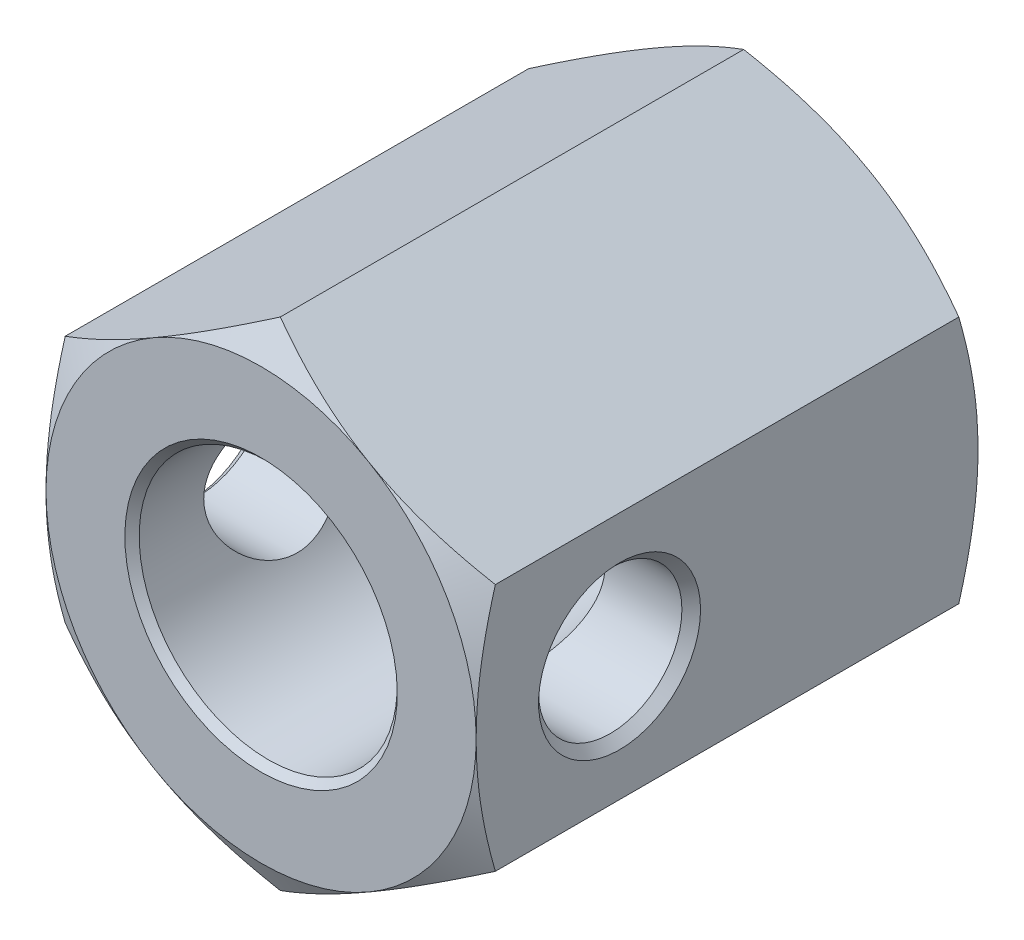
ISO-10303-21;
HEADER;
FILE_DESCRIPTION(('STEP AP214'),'2;1');
FILE_NAME('part.step','',(''),(''),'','','');
FILE_SCHEMA(('AUTOMOTIVE_DESIGN { 1 0 10303 214 1 1 1 1 }'));
ENDSEC;
DATA;
#1=APPLICATION_CONTEXT('core data for automotive mechanical design processes');
#2=APPLICATION_PROTOCOL_DEFINITION('international standard','automotive_design',2000,#1);
#3=PRODUCT_CONTEXT('',#1,'mechanical');
#4=PRODUCT('Part','Part','',(#3));
#5=PRODUCT_RELATED_PRODUCT_CATEGORY('part','',(#4));
#6=PRODUCT_DEFINITION_FORMATION('','',#4);
#7=PRODUCT_DEFINITION_CONTEXT('part definition',#1,'design');
#8=PRODUCT_DEFINITION('design','',#6,#7);
#9=PRODUCT_DEFINITION_SHAPE('','',#8);
#10=(LENGTH_UNIT() NAMED_UNIT(*) SI_UNIT(.MILLI.,.METRE.));
#11=(NAMED_UNIT(*) PLANE_ANGLE_UNIT() SI_UNIT($,.RADIAN.));
#12=(NAMED_UNIT(*) SI_UNIT($,.STERADIAN.) SOLID_ANGLE_UNIT());
#13=UNCERTAINTY_MEASURE_WITH_UNIT(LENGTH_MEASURE(1.E-05),#10,'distance_accuracy_value','');
#14=(GEOMETRIC_REPRESENTATION_CONTEXT(3) GLOBAL_UNCERTAINTY_ASSIGNED_CONTEXT((#13)) GLOBAL_UNIT_ASSIGNED_CONTEXT((#10,
#11,#12)) REPRESENTATION_CONTEXT('',''));
#15=CARTESIAN_POINT('',(0.,0.,0.));
#16=DIRECTION('',(0.,0.,1.));
#17=DIRECTION('',(1.,0.,0.));
#18=AXIS2_PLACEMENT_3D('',#15,#16,#17);
#19=CARTESIAN_POINT('',(-15.,8.66025403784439,35.));
#20=DIRECTION('',(1.,0.,0.));
#21=DIRECTION('',(0.,0.,1.));
#22=AXIS2_PLACEMENT_3D('',#19,#20,#21);
#23=PLANE('',#22);
#24=CARTESIAN_POINT('',(-15.,0.,25.));
#25=DIRECTION('',(1.,0.,0.));
#26=DIRECTION('',(0.,0.,1.));
#27=AXIS2_PLACEMENT_3D('',#24,#25,#26);
#28=CIRCLE('',#27,5.65);
#29=CARTESIAN_POINT('',(-15.,0.,30.65));
#30=VERTEX_POINT('',#29);
#31=EDGE_CURVE('E278',#30,#30,#28,.T.);
#32=ORIENTED_EDGE('',*,*,#31,.T.);
#33=EDGE_LOOP('',(#32));
#34=FACE_BOUND('',#33,.T.);
#35=CARTESIAN_POINT('',(-15.,23.2881768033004,7.33286092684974));
#36=CARTESIAN_POINT('',(-15.,22.9605133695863,7.17382305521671));
#37=CARTESIAN_POINT('',(-15.,22.6324661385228,7.01557629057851));
#38=CARTESIAN_POINT('',(-15.,21.975524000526,6.70084409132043));
#39=CARTESIAN_POINT('',(-15.,21.6466290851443,6.5443586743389));
#40=CARTESIAN_POINT('',(-15.,20.6584654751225,6.07777204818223));
#41=CARTESIAN_POINT('',(-15.,19.9978144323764,5.77058743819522));
#42=CARTESIAN_POINT('',(-15.,18.6685168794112,5.1641999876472));
#43=CARTESIAN_POINT('',(-15.,17.9998464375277,4.86504948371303));
#44=CARTESIAN_POINT('',(-15.,16.6571970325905,4.27895113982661));
#45=CARTESIAN_POINT('',(-15.,15.9832183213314,3.99200272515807));
#46=CARTESIAN_POINT('',(-15.,14.6069970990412,3.42451295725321));
#47=CARTESIAN_POINT('',(-15.,13.9045447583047,3.14447781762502));
#48=CARTESIAN_POINT('',(-15.,12.4914262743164,2.60553849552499));
#49=CARTESIAN_POINT('',(-15.,11.7807592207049,2.34663668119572));
#50=CARTESIAN_POINT('',(-15.,10.3514258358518,1.85674595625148));
#51=CARTESIAN_POINT('',(-15.,9.63277895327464,1.62570075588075));
#52=CARTESIAN_POINT('',(-15.,8.18510822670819,1.19890722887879));
#53=CARTESIAN_POINT('',(-15.,7.45608772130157,1.00314781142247));
#54=CARTESIAN_POINT('',(-15.,6.35667252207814,0.743581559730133));
#55=CARTESIAN_POINT('',(-15.,5.99023466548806,0.662913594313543));
#56=CARTESIAN_POINT('',(-15.,5.25485030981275,0.513892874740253));
#57=CARTESIAN_POINT('',(-15.,4.88590386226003,0.445539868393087));
#58=CARTESIAN_POINT('',(-15.,4.14575375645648,0.322353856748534));
#59=CARTESIAN_POINT('',(-15.,3.77455012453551,0.267520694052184));
#60=CARTESIAN_POINT('',(-15.,3.03027963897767,0.172467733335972));
#61=CARTESIAN_POINT('',(-15.,2.65721286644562,0.132247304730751));
#62=CARTESIAN_POINT('',(-15.,1.9146166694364,0.0677240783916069));
#63=CARTESIAN_POINT('',(-15.,1.54510485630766,0.0432198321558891));
#64=CARTESIAN_POINT('',(-15.,0.80537676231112,0.00986089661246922));
#65=CARTESIAN_POINT('',(-15.,0.435160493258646,0.00100594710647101));
#66=CARTESIAN_POINT('',(-15.,-0.305315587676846,-0.000843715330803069));
#67=CARTESIAN_POINT('',(-15.,-0.675575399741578,0.00616164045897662));
#68=CARTESIAN_POINT('',(-15.,-1.41546924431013,0.0358614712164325));
#69=CARTESIAN_POINT('',(-15.,-1.78510324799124,0.0585566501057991));
#70=CARTESIAN_POINT('',(-15.,-2.67268371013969,0.131409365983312));
#71=CARTESIAN_POINT('',(-15.,-3.19003336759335,0.188968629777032));
#72=CARTESIAN_POINT('',(-15.,-4.22091297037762,0.331694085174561));
#73=CARTESIAN_POINT('',(-15.,-4.7344423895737,0.416864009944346));
#74=CARTESIAN_POINT('',(-15.,-5.75718566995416,0.611781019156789));
#75=CARTESIAN_POINT('',(-15.,-6.26639585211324,0.721547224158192));
#76=CARTESIAN_POINT('',(-15.,-7.27971775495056,0.962305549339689));
#77=CARTESIAN_POINT('',(-15.,-7.78382955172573,1.09329735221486));
#78=CARTESIAN_POINT('',(-15.,-8.7980287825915,1.3764104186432));
#79=CARTESIAN_POINT('',(-15.,-9.30800325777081,1.52893354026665));
#80=CARTESIAN_POINT('',(-15.,-10.3229288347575,1.84978135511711));
#81=CARTESIAN_POINT('',(-15.,-10.82787990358,2.0181061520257));
#82=CARTESIAN_POINT('',(-15.,-11.8330072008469,2.36788099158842));
#83=CARTESIAN_POINT('',(-15.,-12.3331849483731,2.54932668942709));
#84=CARTESIAN_POINT('',(-15.,-13.3293932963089,2.923204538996));
#85=CARTESIAN_POINT('',(-15.,-13.825423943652,3.11563656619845));
#86=CARTESIAN_POINT('',(-15.,-14.9890450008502,3.57952655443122));
#87=CARTESIAN_POINT('',(-15.,-15.655106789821,3.85481295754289));
#88=CARTESIAN_POINT('',(-15.,-16.9816062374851,4.41865636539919));
#89=CARTESIAN_POINT('',(-15.,-17.6420435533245,4.70721417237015));
#90=CARTESIAN_POINT('',(-15.,-18.9583312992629,5.29496331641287));
#91=CARTESIAN_POINT('',(-15.,-19.6141806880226,5.5941569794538));
#92=CARTESIAN_POINT('',(-15.,-20.9219063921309,6.20104866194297));
#93=CARTESIAN_POINT('',(-15.,-21.5737827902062,6.50874650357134));
#94=CARTESIAN_POINT('',(-15.,-22.8749197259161,7.13140408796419));
#95=CARTESIAN_POINT('',(-15.,-23.5241766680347,7.44637133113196));
#96=CARTESIAN_POINT('',(-15.,-24.8198910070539,8.08201138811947));
#97=CARTESIAN_POINT('',(-15.,-25.4663483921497,8.40268422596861));
#98=CARTESIAN_POINT('',(-15.,-26.7568089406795,9.04872242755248));
#99=CARTESIAN_POINT('',(-15.,-27.4008124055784,9.37408718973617));
#100=CARTESIAN_POINT('',(-15.,-28.6867996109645,10.0287861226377));
#101=CARTESIAN_POINT('',(-15.,-29.3287833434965,10.3581203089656));
#102=CARTESIAN_POINT('',(-15.,-31.1455658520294,11.2961020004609));
#103=CARTESIAN_POINT('',(-15.,-32.3183287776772,11.9086927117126));
#104=CARTESIAN_POINT('',(-15.,-34.6594702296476,13.142273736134));
#105=CARTESIAN_POINT('',(-15.,-35.8278486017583,13.7632643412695));
#106=CARTESIAN_POINT('',(-15.,-38.1582765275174,15.0101415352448));
#107=CARTESIAN_POINT('',(-15.,-39.3203345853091,15.6360122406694));
#108=CARTESIAN_POINT('',(-15.,-41.0613498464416,16.5785652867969));
#109=CARTESIAN_POINT('',(-15.,-41.6413274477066,16.893365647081));
#110=CARTESIAN_POINT('',(-15.,-42.8006698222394,17.5240907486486));
#111=CARTESIAN_POINT('',(-15.,-43.3800345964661,17.8400154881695));
#112=CARTESIAN_POINT('',(-15.,-43.9591275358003,18.1564378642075));
#113=B_SPLINE_CURVE_WITH_KNOTS('',3,(#35,#36,#37,#38,#39,#40,#41,#42,#43,#44,#45,#46,#47,#48,
#49,#50,#51,#52,#53,#54,#55,#56,#57,#58,#59,#60,#61,#62,#63,#64,#65,#66,#67,#68,#69,#70,#71,#72,
#73,#74,#75,#76,#77,#78,#79,#80,#81,#82,#83,#84,#85,#86,#87,#88,#89,#90,#91,#92,#93,#94,#95,#96,
#97,#98,#99,#100,#101,#102,#103,#104,#105,#106,#107,#108,#109,#110,#111,#112),.UNSPECIFIED.,.F.,
.F.,(4,2,2,2,2,2,2,2,2,2,2,2,2,2,2,2,2,2,2,2,2,2,2,2,2,2,2,2,2,2,2,2,2,2,2,2,2,2,4),(0.,
1.09265869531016,2.18532832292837,4.37098958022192,6.56850706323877,8.76592092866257,
11.0343020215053,13.3029369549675,15.5669079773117,17.8301661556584,18.9556286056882,
20.0810680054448,21.2064943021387,22.3318720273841,23.4425201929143,24.5531498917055,
25.663784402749,26.7744687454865,28.3352309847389,29.8962043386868,31.4583953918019,
33.0205630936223,34.6171401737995,36.2137277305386,37.8097889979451,39.4058321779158,
41.5677635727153,43.729825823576,45.8923638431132,48.0548566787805,50.2196903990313,
52.3845332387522,54.5491009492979,56.7136771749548,60.682978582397,64.6524183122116,
68.6120526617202,70.5917637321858,72.5714717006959),.UNSPECIFIED.);
#114=CARTESIAN_POINT('',(-15.,-8.66025403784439,1.33974596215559));
#115=VERTEX_POINT('',#114);
#116=CARTESIAN_POINT('',(-15.,0.,0.));
#117=VERTEX_POINT('',#116);
#118=EDGE_CURVE('E404',#115,#117,#113,.F.);
#119=ORIENTED_EDGE('',*,*,#118,.F.);
#120=DIRECTION('',(0.,0.,-1.));
#121=VECTOR('',#120,1.);
#122=CARTESIAN_POINT('',(-15.,-8.66025403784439,35.));
#123=LINE('',#122,#121);
#124=CARTESIAN_POINT('',(-15.,-8.66025403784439,33.6602540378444));
#125=VERTEX_POINT('',#124);
#126=EDGE_CURVE('E338',#125,#115,#123,.T.);
#127=ORIENTED_EDGE('',*,*,#126,.F.);
#128=CARTESIAN_POINT('',(-15.,23.2881768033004,27.6671390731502));
#129=CARTESIAN_POINT('',(-15.,22.9605133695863,27.8261769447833));
#130=CARTESIAN_POINT('',(-15.,22.6324661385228,27.9844237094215));
#131=CARTESIAN_POINT('',(-15.,21.975524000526,28.2991559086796));
#132=CARTESIAN_POINT('',(-15.,21.6466290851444,28.4556413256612));
#133=CARTESIAN_POINT('',(-15.,20.6584654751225,28.9222279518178));
#134=CARTESIAN_POINT('',(-15.,19.9978144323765,29.2294125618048));
#135=CARTESIAN_POINT('',(-15.,18.6685168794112,29.8358000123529));
#136=CARTESIAN_POINT('',(-15.,17.9998464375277,30.134950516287));
#137=CARTESIAN_POINT('',(-15.,16.6571970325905,30.7210488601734));
#138=CARTESIAN_POINT('',(-15.,15.9832183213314,31.007997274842));
#139=CARTESIAN_POINT('',(-15.,14.6069970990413,31.5754870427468));
#140=CARTESIAN_POINT('',(-15.,13.9045447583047,31.855522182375));
#141=CARTESIAN_POINT('',(-15.,12.4914262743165,32.3944615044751));
#142=CARTESIAN_POINT('',(-15.,11.7807592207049,32.6533633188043));
#143=CARTESIAN_POINT('',(-15.,10.3514258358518,33.1432540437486));
#144=CARTESIAN_POINT('',(-15.,9.63277895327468,33.3742992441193));
#145=CARTESIAN_POINT('',(-15.,8.18510822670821,33.8010927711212));
#146=CARTESIAN_POINT('',(-15.,7.45608772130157,33.9968521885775));
#147=CARTESIAN_POINT('',(-15.,6.35667252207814,34.2564184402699));
#148=CARTESIAN_POINT('',(-15.,5.99023466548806,34.3370864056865));
#149=CARTESIAN_POINT('',(-15.,5.25485030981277,34.4861071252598));
#150=CARTESIAN_POINT('',(-15.,4.88590386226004,34.554460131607));
#151=CARTESIAN_POINT('',(-15.,4.14575375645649,34.6776461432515));
#152=CARTESIAN_POINT('',(-15.,3.77455012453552,34.7324793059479));
#153=CARTESIAN_POINT('',(-15.,3.03027963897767,34.8275322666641));
#154=CARTESIAN_POINT('',(-15.,2.65721286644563,34.8677526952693));
#155=CARTESIAN_POINT('',(-15.,1.9146166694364,34.9322759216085));
#156=CARTESIAN_POINT('',(-15.,1.54510485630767,34.9567801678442));
#157=CARTESIAN_POINT('',(-15.,0.805376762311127,34.9901391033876));
#158=CARTESIAN_POINT('',(-15.,0.435160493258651,34.9989940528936));
#159=CARTESIAN_POINT('',(-15.,-0.305315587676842,35.0008437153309));
#160=CARTESIAN_POINT('',(-15.,-0.675575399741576,34.9938383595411));
#161=CARTESIAN_POINT('',(-15.,-1.41546924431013,34.9641385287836));
#162=CARTESIAN_POINT('',(-15.,-1.78510324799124,34.9414433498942));
#163=CARTESIAN_POINT('',(-15.,-2.6726837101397,34.8685906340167));
#164=CARTESIAN_POINT('',(-15.,-3.19003336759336,34.811031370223));
#165=CARTESIAN_POINT('',(-15.,-4.22091297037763,34.6683059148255));
#166=CARTESIAN_POINT('',(-15.,-4.73444238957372,34.5831359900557));
#167=CARTESIAN_POINT('',(-15.,-5.75718566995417,34.3882189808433));
#168=CARTESIAN_POINT('',(-15.,-6.26639585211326,34.2784527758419));
#169=CARTESIAN_POINT('',(-15.,-7.27971775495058,34.0376944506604));
#170=CARTESIAN_POINT('',(-15.,-7.78382955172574,33.9067026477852));
#171=CARTESIAN_POINT('',(-15.,-8.79802878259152,33.6235895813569));
#172=CARTESIAN_POINT('',(-15.,-9.30800325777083,33.4710664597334));
#173=CARTESIAN_POINT('',(-15.,-10.3229288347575,33.1502186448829));
#174=CARTESIAN_POINT('',(-15.,-10.82787990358,32.9818938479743));
#175=CARTESIAN_POINT('',(-15.,-11.8330072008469,32.6321190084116));
#176=CARTESIAN_POINT('',(-15.,-12.3331849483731,32.450673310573));
#177=CARTESIAN_POINT('',(-15.,-13.3293932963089,32.076795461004));
#178=CARTESIAN_POINT('',(-15.,-13.8254239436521,31.8843634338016));
#179=CARTESIAN_POINT('',(-15.,-14.9890450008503,31.4204734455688));
#180=CARTESIAN_POINT('',(-15.,-15.655106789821,31.1451870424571));
#181=CARTESIAN_POINT('',(-15.,-16.9816062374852,30.5813436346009));
#182=CARTESIAN_POINT('',(-15.,-17.6420435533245,30.2927858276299));
#183=CARTESIAN_POINT('',(-15.,-18.958331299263,29.7050366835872));
#184=CARTESIAN_POINT('',(-15.,-19.6141806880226,29.4058430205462));
#185=CARTESIAN_POINT('',(-15.,-20.9219063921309,28.7989513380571));
#186=CARTESIAN_POINT('',(-15.,-21.5737827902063,28.4912534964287));
#187=CARTESIAN_POINT('',(-15.,-22.8749197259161,27.8685959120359));
#188=CARTESIAN_POINT('',(-15.,-23.5241766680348,27.5536286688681));
#189=CARTESIAN_POINT('',(-15.,-24.8198910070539,26.9179886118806));
#190=CARTESIAN_POINT('',(-15.,-25.4663483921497,26.5973157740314));
#191=CARTESIAN_POINT('',(-15.,-26.7568089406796,25.9512775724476));
#192=CARTESIAN_POINT('',(-15.,-27.4008124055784,25.6259128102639));
#193=CARTESIAN_POINT('',(-15.,-28.6867996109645,24.9712138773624));
#194=CARTESIAN_POINT('',(-15.,-29.3287833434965,24.6418796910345));
#195=CARTESIAN_POINT('',(-15.,-31.1455658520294,23.7038979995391));
#196=CARTESIAN_POINT('',(-15.,-32.3183287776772,23.0913072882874));
#197=CARTESIAN_POINT('',(-15.,-34.6594702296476,21.857726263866));
#198=CARTESIAN_POINT('',(-15.,-35.8278486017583,21.2367356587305));
#199=CARTESIAN_POINT('',(-15.,-38.1582765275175,19.9898584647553));
#200=CARTESIAN_POINT('',(-15.,-39.3203345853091,19.3639877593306));
#201=CARTESIAN_POINT('',(-15.,-41.0613498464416,18.4214347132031));
#202=CARTESIAN_POINT('',(-15.,-41.6413274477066,18.106634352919));
#203=CARTESIAN_POINT('',(-15.,-42.8006698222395,17.4759092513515));
#204=CARTESIAN_POINT('',(-15.,-43.3800345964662,17.1599845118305));
#205=CARTESIAN_POINT('',(-15.,-43.9591275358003,16.8435621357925));
#206=B_SPLINE_CURVE_WITH_KNOTS('',3,(#128,#129,#130,#131,#132,#133,#134,#135,#136,#137,#138,
#139,#140,#141,#142,#143,#144,#145,#146,#147,#148,#149,#150,#151,#152,#153,#154,#155,#156,#157,
#158,#159,#160,#161,#162,#163,#164,#165,#166,#167,#168,#169,#170,#171,#172,#173,#174,#175,#176,
#177,#178,#179,#180,#181,#182,#183,#184,#185,#186,#187,#188,#189,#190,#191,#192,#193,#194,#195,
#196,#197,#198,#199,#200,#201,#202,#203,#204,#205),.UNSPECIFIED.,.F.,.F.,(4,2,2,2,2,2,2,2,2,2,2,
2,2,2,2,2,2,2,2,2,2,2,2,2,2,2,2,2,2,2,2,2,2,2,2,2,2,2,4),(0.,1.09265869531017,2.18532832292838,
4.37098958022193,6.56850706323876,8.76592092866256,11.0343020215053,13.3029369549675,
15.5669079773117,17.8301661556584,18.9556286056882,20.0810680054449,21.2064943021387,
22.3318720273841,23.4425201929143,24.5531498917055,25.6637844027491,26.7744687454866,
28.3352309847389,29.8962043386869,31.4583953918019,33.0205630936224,34.6171401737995,
36.2137277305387,37.8097889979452,39.4058321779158,41.5677635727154,43.7298258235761,
45.8923638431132,48.0548566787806,50.2196903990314,52.3845332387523,54.549100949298,
56.7136771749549,60.6829785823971,64.6524183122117,68.6120526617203,70.5917637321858,
72.571471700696),.UNSPECIFIED.);
#207=CARTESIAN_POINT('',(-15.,0.,35.));
#208=VERTEX_POINT('',#207);
#209=EDGE_CURVE('E238',#208,#125,#206,.T.);
#210=ORIENTED_EDGE('',*,*,#209,.F.);
#211=CARTESIAN_POINT('',(-15.,8.66025403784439,33.6602540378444));
#212=VERTEX_POINT('',#211);
#213=EDGE_CURVE('E412',#212,#208,#206,.T.);
#214=ORIENTED_EDGE('',*,*,#213,.F.);
#215=DIRECTION('',(0.,0.,-1.));
#216=VECTOR('',#215,1.);
#217=CARTESIAN_POINT('',(-15.,8.66025403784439,35.));
#218=LINE('',#217,#216);
#219=CARTESIAN_POINT('',(-15.,8.66025403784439,1.33974596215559));
#220=VERTEX_POINT('',#219);
#221=EDGE_CURVE('E386',#212,#220,#218,.T.);
#222=ORIENTED_EDGE('',*,*,#221,.T.);
#223=EDGE_CURVE('E192',#117,#220,#113,.F.);
#224=ORIENTED_EDGE('',*,*,#223,.F.);
#225=EDGE_LOOP('',(#119,#127,#210,#214,#222,#224));
#226=FACE_BOUND('',#225,.T.);
#227=ADVANCED_FACE('F14',(#34,#226),#23,.F.);
#228=CARTESIAN_POINT('',(-15.,-8.66025403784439,35.));
#229=DIRECTION('',(0.5,0.866025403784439,0.));
#230=DIRECTION('',(-0.866025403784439,0.5,0.));
#231=AXIS2_PLACEMENT_3D('',#228,#229,#230);
#232=PLANE('',#231);
#233=CARTESIAN_POINT('',(0.000199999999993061,-17.3206235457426,1.33981262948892));
#234=CARTESIAN_POINT('',(-0.329494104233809,-17.130274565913,1.22992178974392));
#235=CARTESIAN_POINT('',(-0.660474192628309,-16.939183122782,1.1250175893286));
#236=CARTESIAN_POINT('',(-1.32508844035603,-16.5554679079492,0.926568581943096));
#237=CARTESIAN_POINT('',(-1.65872343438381,-16.3628436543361,0.833027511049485));
#238=CARTESIAN_POINT('',(-2.32929228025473,-15.9756905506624,0.658562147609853));
#239=CARTESIAN_POINT('',(-2.66623200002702,-15.7811583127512,0.577667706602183));
#240=CARTESIAN_POINT('',(-3.34245276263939,-15.3907420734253,0.43023264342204));
#241=CARTESIAN_POINT('',(-3.68173367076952,-15.1948581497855,0.363691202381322));
#242=CARTESIAN_POINT('',(-4.35394314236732,-14.8067578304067,0.247792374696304));
#243=CARTESIAN_POINT('',(-4.68682180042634,-14.6145702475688,0.198051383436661));
#244=CARTESIAN_POINT('',(-5.35410443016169,-14.2293144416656,0.114646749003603));
#245=CARTESIAN_POINT('',(-5.68850843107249,-14.0362462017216,0.0809834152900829));
#246=CARTESIAN_POINT('',(-6.35787818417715,-13.6497853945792,0.0305840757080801));
#247=CARTESIAN_POINT('',(-6.69284279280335,-13.4563934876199,0.013827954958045));
#248=CARTESIAN_POINT('',(-7.363081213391,-13.0694311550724,-0.00239660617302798));
#249=CARTESIAN_POINT('',(-7.69835501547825,-12.8758607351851,-0.00186558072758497));
#250=CARTESIAN_POINT('',(-8.3251468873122,-12.5139822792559,0.0152766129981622));
#251=CARTESIAN_POINT('',(-8.61670962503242,-12.3456484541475,0.0297968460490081));
#252=CARTESIAN_POINT('',(-9.19916443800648,-12.0093680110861,0.0716371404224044));
#253=CARTESIAN_POINT('',(-9.49005646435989,-11.8414214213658,0.0989581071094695));
#254=CARTESIAN_POINT('',(-10.0710118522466,-11.5060066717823,0.165923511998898));
#255=CARTESIAN_POINT('',(-10.3610743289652,-11.338539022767,0.205578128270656));
#256=CARTESIAN_POINT('',(-10.939839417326,-11.0043888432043,0.296515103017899));
#257=CARTESIAN_POINT('',(-11.2285419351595,-10.8377063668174,0.347798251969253));
#258=CARTESIAN_POINT('',(-12.1049144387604,-10.3317324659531,0.520386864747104));
#259=CARTESIAN_POINT('',(-12.6900465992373,-9.99390625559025,0.658901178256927));
#260=CARTESIAN_POINT('',(-13.8515859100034,-9.32329122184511,0.973271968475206));
#261=CARTESIAN_POINT('',(-14.4280079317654,-8.99049381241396,1.14905461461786));
#262=CARTESIAN_POINT('',(-15.0002,-8.66013856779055,1.33981262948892));
#263=B_SPLINE_CURVE_WITH_KNOTS('',3,(#233,#234,#235,#236,#237,#238,#239,#240,#241,#242,#243,
#244,#245,#246,#247,#248,#249,#250,#251,#252,#253,#254,#255,#256,#257,#258,#259,#260,#261,#262),
.UNSPECIFIED.,.F.,.F.,(4,2,2,2,2,2,2,2,2,2,2,2,2,2,4),(0.,1.18875411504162,2.37789802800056,
3.56980778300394,4.76164951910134,5.92407379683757,7.08652044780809,8.24758247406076,
9.40860862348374,10.4193068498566,11.4300765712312,12.4416826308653,13.4533574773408,
15.5211962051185,17.584976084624),.UNSPECIFIED.);
#264=CARTESIAN_POINT('',(0.,-17.3205080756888,1.33974596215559));
#265=VERTEX_POINT('',#264);
#266=CARTESIAN_POINT('',(-7.5,-12.9903810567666,0.));
#267=VERTEX_POINT('',#266);
#268=EDGE_CURVE('E124',#265,#267,#263,.T.);
#269=ORIENTED_EDGE('',*,*,#268,.F.);
#270=DIRECTION('',(0.,0.,-1.));
#271=VECTOR('',#270,1.);
#272=CARTESIAN_POINT('',(0.,-17.3205080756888,35.));
#273=LINE('',#272,#271);
#274=CARTESIAN_POINT('',(0.,-17.3205080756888,33.6602540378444));
#275=VERTEX_POINT('',#274);
#276=EDGE_CURVE('E140',#275,#265,#273,.T.);
#277=ORIENTED_EDGE('',*,*,#276,.F.);
#278=CARTESIAN_POINT('',(-15.0002,-8.66013856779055,33.6601873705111));
#279=CARTESIAN_POINT('',(-14.6705058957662,-8.85048754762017,33.7700782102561));
#280=CARTESIAN_POINT('',(-14.3395258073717,-9.04157899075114,33.8749824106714));
#281=CARTESIAN_POINT('',(-13.674911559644,-9.42529420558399,34.073431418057));
#282=CARTESIAN_POINT('',(-13.3412765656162,-9.61791845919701,34.1669724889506));
#283=CARTESIAN_POINT('',(-12.6707077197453,-10.0050715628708,34.3414378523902));
#284=CARTESIAN_POINT('',(-12.333767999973,-10.199603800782,34.4223322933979));
#285=CARTESIAN_POINT('',(-11.6575472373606,-10.5900200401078,34.569767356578));
#286=CARTESIAN_POINT('',(-11.3182663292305,-10.7859039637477,34.6363087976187));
#287=CARTESIAN_POINT('',(-10.6460568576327,-11.1740042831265,34.7522076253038));
#288=CARTESIAN_POINT('',(-10.3131781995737,-11.3661918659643,34.8019486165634));
#289=CARTESIAN_POINT('',(-9.64589556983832,-11.7514476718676,34.8853532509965));
#290=CARTESIAN_POINT('',(-9.31149156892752,-11.9445159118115,34.91901658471));
#291=CARTESIAN_POINT('',(-8.64212181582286,-12.3309767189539,34.969415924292));
#292=CARTESIAN_POINT('',(-8.30715720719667,-12.5243686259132,34.986172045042));
#293=CARTESIAN_POINT('',(-7.63691878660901,-12.9113309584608,35.0023966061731));
#294=CARTESIAN_POINT('',(-7.30164498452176,-13.104901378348,35.0018655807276));
#295=CARTESIAN_POINT('',(-6.6748531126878,-13.4667798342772,34.9847233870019));
#296=CARTESIAN_POINT('',(-6.38329037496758,-13.6351136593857,34.970203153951));
#297=CARTESIAN_POINT('',(-5.80083556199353,-13.9713941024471,34.9283628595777));
#298=CARTESIAN_POINT('',(-5.50994353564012,-14.1393406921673,34.9010418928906));
#299=CARTESIAN_POINT('',(-4.92898814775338,-14.4747554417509,34.8340764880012));
#300=CARTESIAN_POINT('',(-4.63892567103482,-14.6422230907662,34.7944218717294));
#301=CARTESIAN_POINT('',(-4.06016058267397,-14.9763732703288,34.7034848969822));
#302=CARTESIAN_POINT('',(-3.77145806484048,-15.1430557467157,34.6522017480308));
#303=CARTESIAN_POINT('',(-2.8950855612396,-15.6490296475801,34.479613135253));
#304=CARTESIAN_POINT('',(-2.30995340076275,-15.9868558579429,34.3410988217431));
#305=CARTESIAN_POINT('',(-1.14841408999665,-16.6574708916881,34.0267280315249));
#306=CARTESIAN_POINT('',(-0.571992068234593,-16.9902683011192,33.8509453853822));
#307=CARTESIAN_POINT('',(0.000199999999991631,-17.3206235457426,33.6601873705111));
#308=B_SPLINE_CURVE_WITH_KNOTS('',3,(#278,#279,#280,#281,#282,#283,#284,#285,#286,#287,#288,
#289,#290,#291,#292,#293,#294,#295,#296,#297,#298,#299,#300,#301,#302,#303,#304,#305,#306,#307),
.UNSPECIFIED.,.F.,.F.,(4,2,2,2,2,2,2,2,2,2,2,2,2,2,4),(0.,1.18875411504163,2.37789802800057,
3.56980778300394,4.76164951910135,5.92407379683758,7.0865204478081,8.24758247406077,
9.40860862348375,10.4193068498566,11.4300765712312,12.4416826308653,13.4533574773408,
15.5211962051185,17.5849760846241),.UNSPECIFIED.);
#309=CARTESIAN_POINT('',(-7.5,-12.9903810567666,35.));
#310=VERTEX_POINT('',#309);
#311=EDGE_CURVE('E231',#310,#275,#308,.T.);
#312=ORIENTED_EDGE('',*,*,#311,.F.);
#313=EDGE_CURVE('E237',#125,#310,#308,.T.);
#314=ORIENTED_EDGE('',*,*,#313,.F.);
#315=ORIENTED_EDGE('',*,*,#126,.T.);
#316=EDGE_CURVE('E150',#267,#115,#263,.T.);
#317=ORIENTED_EDGE('',*,*,#316,.F.);
#318=EDGE_LOOP('',(#269,#277,#312,#314,#315,#317));
#319=FACE_BOUND('',#318,.T.);
#320=ADVANCED_FACE('F244',(#319),#232,.F.);
#321=CARTESIAN_POINT('',(0.,-17.3205080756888,35.));
#322=DIRECTION('',(-0.5,0.866025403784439,0.));
#323=DIRECTION('',(-0.866025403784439,-0.5,0.));
#324=AXIS2_PLACEMENT_3D('',#321,#322,#323);
#325=PLANE('',#324);
#326=CARTESIAN_POINT('',(15.0002,-8.66013856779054,1.33981262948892));
#327=CARTESIAN_POINT('',(14.6705058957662,-8.85048754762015,1.22992178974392));
#328=CARTESIAN_POINT('',(14.3395258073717,-9.04157899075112,1.12501758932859));
#329=CARTESIAN_POINT('',(13.674911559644,-9.42529420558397,0.926568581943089));
#330=CARTESIAN_POINT('',(13.3412765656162,-9.61791845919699,0.833027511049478));
#331=CARTESIAN_POINT('',(12.6707077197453,-10.0050715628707,0.658562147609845));
#332=CARTESIAN_POINT('',(12.333767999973,-10.199603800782,0.577667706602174));
#333=CARTESIAN_POINT('',(11.6575472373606,-10.5900200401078,0.43023264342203));
#334=CARTESIAN_POINT('',(11.3182663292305,-10.7859039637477,0.363691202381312));
#335=CARTESIAN_POINT('',(10.6460568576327,-11.1740042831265,0.247792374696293));
#336=CARTESIAN_POINT('',(10.3131781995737,-11.3661918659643,0.19805138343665));
#337=CARTESIAN_POINT('',(9.6458955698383,-11.7514476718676,0.114646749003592));
#338=CARTESIAN_POINT('',(9.31149156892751,-11.9445159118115,0.080983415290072));
#339=CARTESIAN_POINT('',(8.64212181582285,-12.3309767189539,0.0305840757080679));
#340=CARTESIAN_POINT('',(8.30715720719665,-12.5243686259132,0.013827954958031));
#341=CARTESIAN_POINT('',(7.636918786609,-12.9113309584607,-0.002396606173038));
#342=CARTESIAN_POINT('',(7.30164498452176,-13.104901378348,-0.00186558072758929));
#343=CARTESIAN_POINT('',(6.6748531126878,-13.4667798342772,0.0152766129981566));
#344=CARTESIAN_POINT('',(6.38329037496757,-13.6351136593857,0.0297968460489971));
#345=CARTESIAN_POINT('',(5.80083556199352,-13.971394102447,0.0716371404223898));
#346=CARTESIAN_POINT('',(5.50994353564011,-14.1393406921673,0.0989581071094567));
#347=CARTESIAN_POINT('',(4.92898814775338,-14.4747554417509,0.165923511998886));
#348=CARTESIAN_POINT('',(4.63892567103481,-14.6422230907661,0.205578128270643));
#349=CARTESIAN_POINT('',(4.06016058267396,-14.9763732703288,0.296515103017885));
#350=CARTESIAN_POINT('',(3.77145806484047,-15.1430557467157,0.347798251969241));
#351=CARTESIAN_POINT('',(2.89508556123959,-15.6490296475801,0.520386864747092));
#352=CARTESIAN_POINT('',(2.30995340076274,-15.9868558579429,0.658901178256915));
#353=CARTESIAN_POINT('',(1.14841408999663,-16.657470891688,0.973271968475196));
#354=CARTESIAN_POINT('',(0.571992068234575,-16.9902683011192,1.14905461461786));
#355=CARTESIAN_POINT('',(-0.000200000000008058,-17.3206235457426,1.33981262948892));
#356=B_SPLINE_CURVE_WITH_KNOTS('',3,(#326,#327,#328,#329,#330,#331,#332,#333,#334,#335,#336,
#337,#338,#339,#340,#341,#342,#343,#344,#345,#346,#347,#348,#349,#350,#351,#352,#353,#354,#355),
.UNSPECIFIED.,.F.,.F.,(4,2,2,2,2,2,2,2,2,2,2,2,2,2,4),(0.,1.18875411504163,2.37789802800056,
3.56980778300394,4.76164951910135,5.92407379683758,7.0865204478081,8.24758247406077,
9.40860862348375,10.4193068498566,11.4300765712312,12.4416826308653,13.4533574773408,
15.5211962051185,17.5849760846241),.UNSPECIFIED.);
#357=CARTESIAN_POINT('',(15.,-8.66025403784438,1.33974596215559));
#358=VERTEX_POINT('',#357);
#359=CARTESIAN_POINT('',(7.5,-12.9903810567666,0.));
#360=VERTEX_POINT('',#359);
#361=EDGE_CURVE('E103',#358,#360,#356,.T.);
#362=ORIENTED_EDGE('',*,*,#361,.F.);
#363=DIRECTION('',(0.,0.,-1.));
#364=VECTOR('',#363,1.);
#365=CARTESIAN_POINT('',(15.,-8.66025403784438,35.));
#366=LINE('',#365,#364);
#367=CARTESIAN_POINT('',(15.,-8.66025403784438,33.6602540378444));
#368=VERTEX_POINT('',#367);
#369=EDGE_CURVE('E388',#368,#358,#366,.T.);
#370=ORIENTED_EDGE('',*,*,#369,.F.);
#371=CARTESIAN_POINT('',(-0.000200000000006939,-17.3206235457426,33.6601873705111));
#372=CARTESIAN_POINT('',(0.329494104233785,-17.130274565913,33.7700782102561));
#373=CARTESIAN_POINT('',(0.660474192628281,-16.939183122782,33.8749824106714));
#374=CARTESIAN_POINT('',(1.325088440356,-16.5554679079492,34.073431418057));
#375=CARTESIAN_POINT('',(1.65872343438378,-16.3628436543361,34.1669724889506));
#376=CARTESIAN_POINT('',(2.3292922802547,-15.9756905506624,34.3414378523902));
#377=CARTESIAN_POINT('',(2.66623200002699,-15.7811583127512,34.4223322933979));
#378=CARTESIAN_POINT('',(3.34245276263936,-15.3907420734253,34.569767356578));
#379=CARTESIAN_POINT('',(3.68173367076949,-15.1948581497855,34.6363087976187));
#380=CARTESIAN_POINT('',(4.35394314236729,-14.8067578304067,34.7522076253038));
#381=CARTESIAN_POINT('',(4.68682180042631,-14.6145702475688,34.8019486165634));
#382=CARTESIAN_POINT('',(5.35410443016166,-14.2293144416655,34.8853532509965));
#383=CARTESIAN_POINT('',(5.68850843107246,-14.0362462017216,34.91901658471));
#384=CARTESIAN_POINT('',(6.35787818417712,-13.6497853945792,34.969415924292));
#385=CARTESIAN_POINT('',(6.69284279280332,-13.4563934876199,34.986172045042));
#386=CARTESIAN_POINT('',(7.36308121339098,-13.0694311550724,35.0023966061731));
#387=CARTESIAN_POINT('',(7.69835501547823,-12.8758607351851,35.0018655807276));
#388=CARTESIAN_POINT('',(8.32514688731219,-12.5139822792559,34.9847233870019));
#389=CARTESIAN_POINT('',(8.6167096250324,-12.3456484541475,34.9702031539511));
#390=CARTESIAN_POINT('',(9.19916443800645,-12.0093680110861,34.9283628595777));
#391=CARTESIAN_POINT('',(9.49005646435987,-11.8414214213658,34.9010418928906));
#392=CARTESIAN_POINT('',(10.0710118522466,-11.5060066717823,34.8340764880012));
#393=CARTESIAN_POINT('',(10.3610743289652,-11.338539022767,34.7944218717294));
#394=CARTESIAN_POINT('',(10.939839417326,-11.0043888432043,34.7034848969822));
#395=CARTESIAN_POINT('',(11.2285419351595,-10.8377063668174,34.6522017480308));
#396=CARTESIAN_POINT('',(12.1049144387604,-10.331732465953,34.479613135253));
#397=CARTESIAN_POINT('',(12.6900465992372,-9.99390625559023,34.3410988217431));
#398=CARTESIAN_POINT('',(13.8515859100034,-9.32329122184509,34.0267280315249));
#399=CARTESIAN_POINT('',(14.4280079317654,-8.99049381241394,33.8509453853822));
#400=CARTESIAN_POINT('',(15.0002,-8.66013856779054,33.6601873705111));
#401=B_SPLINE_CURVE_WITH_KNOTS('',3,(#371,#372,#373,#374,#375,#376,#377,#378,#379,#380,#381,
#382,#383,#384,#385,#386,#387,#388,#389,#390,#391,#392,#393,#394,#395,#396,#397,#398,#399,#400),
.UNSPECIFIED.,.F.,.F.,(4,2,2,2,2,2,2,2,2,2,2,2,2,2,4),(0.,1.18875411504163,2.37789802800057,
3.56980778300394,4.76164951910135,5.92407379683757,7.0865204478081,8.24758247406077,
9.40860862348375,10.4193068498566,11.4300765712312,12.4416826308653,13.4533574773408,
15.5211962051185,17.5849760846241),.UNSPECIFIED.);
#402=CARTESIAN_POINT('',(7.5,-12.9903810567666,35.));
#403=VERTEX_POINT('',#402);
#404=EDGE_CURVE('E224',#403,#368,#401,.T.);
#405=ORIENTED_EDGE('',*,*,#404,.F.);
#406=EDGE_CURVE('E230',#275,#403,#401,.T.);
#407=ORIENTED_EDGE('',*,*,#406,.F.);
#408=ORIENTED_EDGE('',*,*,#276,.T.);
#409=EDGE_CURVE('E116',#360,#265,#356,.T.);
#410=ORIENTED_EDGE('',*,*,#409,.F.);
#411=EDGE_LOOP('',(#362,#370,#405,#407,#408,#410));
#412=FACE_BOUND('',#411,.T.);
#413=ADVANCED_FACE('F137',(#412),#325,.F.);
#414=CARTESIAN_POINT('',(15.,-8.66025403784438,35.));
#415=DIRECTION('',(-1.,0.,0.));
#416=DIRECTION('',(0.,0.,-1.));
#417=AXIS2_PLACEMENT_3D('',#414,#415,#416);
#418=PLANE('',#417);
#419=CARTESIAN_POINT('',(15.,0.,25.));
#420=DIRECTION('',(-1.,0.,0.));
#421=DIRECTION('',(0.,0.,-1.));
#422=AXIS2_PLACEMENT_3D('',#419,#420,#421);
#423=CIRCLE('',#422,5.65);
#424=CARTESIAN_POINT('',(15.,0.,19.35));
#425=VERTEX_POINT('',#424);
#426=EDGE_CURVE('E9',#425,#425,#423,.T.);
#427=ORIENTED_EDGE('',*,*,#426,.T.);
#428=EDGE_LOOP('',(#427));
#429=FACE_BOUND('',#428,.T.);
#430=CARTESIAN_POINT('',(15.,23.2881768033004,7.33286092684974));
#431=CARTESIAN_POINT('',(15.,22.9605133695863,7.17382305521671));
#432=CARTESIAN_POINT('',(15.,22.6324661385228,7.01557629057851));
#433=CARTESIAN_POINT('',(15.,21.975524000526,6.70084409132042));
#434=CARTESIAN_POINT('',(15.,21.6466290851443,6.5443586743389));
#435=CARTESIAN_POINT('',(15.,20.6584654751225,6.07777204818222));
#436=CARTESIAN_POINT('',(15.,19.9978144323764,5.77058743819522));
#437=CARTESIAN_POINT('',(15.,18.6685168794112,5.1641999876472));
#438=CARTESIAN_POINT('',(15.,17.9998464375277,4.86504948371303));
#439=CARTESIAN_POINT('',(15.,16.6571970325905,4.27895113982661));
#440=CARTESIAN_POINT('',(15.,15.9832183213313,3.99200272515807));
#441=CARTESIAN_POINT('',(15.,14.6069970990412,3.4245129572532));
#442=CARTESIAN_POINT('',(15.,13.9045447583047,3.14447781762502));
#443=CARTESIAN_POINT('',(15.,12.4914262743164,2.60553849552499));
#444=CARTESIAN_POINT('',(15.,11.7807592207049,2.34663668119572));
#445=CARTESIAN_POINT('',(15.,10.3514258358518,1.85674595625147));
#446=CARTESIAN_POINT('',(15.,9.63277895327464,1.62570075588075));
#447=CARTESIAN_POINT('',(15.,8.18510822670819,1.19890722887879));
#448=CARTESIAN_POINT('',(15.,7.45608772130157,1.00314781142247));
#449=CARTESIAN_POINT('',(15.,6.35667252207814,0.743581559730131));
#450=CARTESIAN_POINT('',(15.,5.99023466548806,0.662913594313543));
#451=CARTESIAN_POINT('',(15.,5.25485030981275,0.513892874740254));
#452=CARTESIAN_POINT('',(15.,4.88590386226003,0.445539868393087));
#453=CARTESIAN_POINT('',(15.,4.14575375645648,0.322353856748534));
#454=CARTESIAN_POINT('',(15.,3.77455012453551,0.267520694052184));
#455=CARTESIAN_POINT('',(15.,3.03027963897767,0.172467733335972));
#456=CARTESIAN_POINT('',(15.,2.65721286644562,0.132247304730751));
#457=CARTESIAN_POINT('',(15.,1.9146166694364,0.0677240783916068));
#458=CARTESIAN_POINT('',(15.,1.54510485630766,0.0432198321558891));
#459=CARTESIAN_POINT('',(15.,0.805376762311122,0.00986089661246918));
#460=CARTESIAN_POINT('',(15.,0.435160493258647,0.00100594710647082));
#461=CARTESIAN_POINT('',(15.,-0.305315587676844,-0.000843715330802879));
#462=CARTESIAN_POINT('',(15.,-0.675575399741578,0.00616164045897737));
#463=CARTESIAN_POINT('',(15.,-1.41546924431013,0.0358614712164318));
#464=CARTESIAN_POINT('',(15.,-1.78510324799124,0.0585566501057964));
#465=CARTESIAN_POINT('',(15.,-2.6726837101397,0.131409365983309));
#466=CARTESIAN_POINT('',(15.,-3.19003336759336,0.188968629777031));
#467=CARTESIAN_POINT('',(15.,-4.22091297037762,0.331694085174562));
#468=CARTESIAN_POINT('',(15.,-4.7344423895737,0.416864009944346));
#469=CARTESIAN_POINT('',(15.,-5.75718566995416,0.611781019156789));
#470=CARTESIAN_POINT('',(15.,-6.26639585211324,0.721547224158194));
#471=CARTESIAN_POINT('',(15.,-7.27971775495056,0.962305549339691));
#472=CARTESIAN_POINT('',(15.,-7.78382955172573,1.09329735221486));
#473=CARTESIAN_POINT('',(15.,-8.7980287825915,1.3764104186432));
#474=CARTESIAN_POINT('',(15.,-9.30800325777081,1.52893354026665));
#475=CARTESIAN_POINT('',(15.,-10.3229288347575,1.84978135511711));
#476=CARTESIAN_POINT('',(15.,-10.82787990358,2.0181061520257));
#477=CARTESIAN_POINT('',(15.,-11.8330072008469,2.36788099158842));
#478=CARTESIAN_POINT('',(15.,-12.3331849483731,2.54932668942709));
#479=CARTESIAN_POINT('',(15.,-13.3293932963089,2.923204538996));
#480=CARTESIAN_POINT('',(15.,-13.825423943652,3.11563656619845));
#481=CARTESIAN_POINT('',(15.,-14.9890450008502,3.57952655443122));
#482=CARTESIAN_POINT('',(15.,-15.655106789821,3.85481295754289));
#483=CARTESIAN_POINT('',(15.,-16.9816062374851,4.41865636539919));
#484=CARTESIAN_POINT('',(15.,-17.6420435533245,4.70721417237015));
#485=CARTESIAN_POINT('',(15.,-18.9583312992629,5.29496331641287));
#486=CARTESIAN_POINT('',(15.,-19.6141806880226,5.5941569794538));
#487=CARTESIAN_POINT('',(15.,-20.9219063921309,6.20104866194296));
#488=CARTESIAN_POINT('',(15.,-21.5737827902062,6.50874650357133));
#489=CARTESIAN_POINT('',(15.,-22.8749197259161,7.13140408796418));
#490=CARTESIAN_POINT('',(15.,-23.5241766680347,7.44637133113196));
#491=CARTESIAN_POINT('',(15.,-24.8198910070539,8.08201138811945));
#492=CARTESIAN_POINT('',(15.,-25.4663483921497,8.4026842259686));
#493=CARTESIAN_POINT('',(15.,-26.7568089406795,9.04872242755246));
#494=CARTESIAN_POINT('',(15.,-27.4008124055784,9.37408718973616));
#495=CARTESIAN_POINT('',(15.,-28.6867996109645,10.0287861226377));
#496=CARTESIAN_POINT('',(15.,-29.3287833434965,10.3581203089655));
#497=CARTESIAN_POINT('',(15.,-31.1455658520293,11.2961020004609));
#498=CARTESIAN_POINT('',(15.,-32.3183287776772,11.9086927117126));
#499=CARTESIAN_POINT('',(15.,-34.6594702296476,13.142273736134));
#500=CARTESIAN_POINT('',(15.,-35.8278486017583,13.7632643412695));
#501=CARTESIAN_POINT('',(15.,-38.1582765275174,15.0101415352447));
#502=CARTESIAN_POINT('',(15.,-39.3203345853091,15.6360122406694));
#503=CARTESIAN_POINT('',(15.,-41.0613498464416,16.5785652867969));
#504=CARTESIAN_POINT('',(15.,-41.6413274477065,16.893365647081));
#505=CARTESIAN_POINT('',(15.,-42.8006698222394,17.5240907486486));
#506=CARTESIAN_POINT('',(15.,-43.3800345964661,17.8400154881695));
#507=CARTESIAN_POINT('',(15.,-43.9591275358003,18.1564378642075));
#508=B_SPLINE_CURVE_WITH_KNOTS('',3,(#430,#431,#432,#433,#434,#435,#436,#437,#438,#439,#440,
#441,#442,#443,#444,#445,#446,#447,#448,#449,#450,#451,#452,#453,#454,#455,#456,#457,#458,#459,
#460,#461,#462,#463,#464,#465,#466,#467,#468,#469,#470,#471,#472,#473,#474,#475,#476,#477,#478,
#479,#480,#481,#482,#483,#484,#485,#486,#487,#488,#489,#490,#491,#492,#493,#494,#495,#496,#497,
#498,#499,#500,#501,#502,#503,#504,#505,#506,#507),.UNSPECIFIED.,.F.,.F.,(4,2,2,2,2,2,2,2,2,2,2,
2,2,2,2,2,2,2,2,2,2,2,2,2,2,2,2,2,2,2,2,2,2,2,2,2,2,2,4),(0.,1.09265869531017,2.18532832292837,
4.37098958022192,6.56850706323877,8.76592092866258,11.0343020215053,13.3029369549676,
15.5669079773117,17.8301661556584,18.9556286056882,20.0810680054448,21.2064943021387,
22.3318720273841,23.4425201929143,24.5531498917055,25.663784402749,26.7744687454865,
28.3352309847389,29.8962043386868,31.4583953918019,33.0205630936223,34.6171401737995,
36.2137277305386,37.8097889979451,39.4058321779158,41.5677635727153,43.729825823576,
45.8923638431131,48.0548566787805,50.2196903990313,52.3845332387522,54.5491009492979,
56.7136771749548,60.682978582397,64.6524183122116,68.6120526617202,70.5917637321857,
72.5714717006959),.UNSPECIFIED.);
#509=CARTESIAN_POINT('',(15.,8.66025403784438,1.33974596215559));
#510=VERTEX_POINT('',#509);
#511=CARTESIAN_POINT('',(15.,0.,0.));
#512=VERTEX_POINT('',#511);
#513=EDGE_CURVE('E29',#510,#512,#508,.T.);
#514=ORIENTED_EDGE('',*,*,#513,.F.);
#515=DIRECTION('',(0.,0.,-1.));
#516=VECTOR('',#515,1.);
#517=CARTESIAN_POINT('',(15.,8.66025403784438,35.));
#518=LINE('',#517,#516);
#519=CARTESIAN_POINT('',(15.,8.66025403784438,33.6602540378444));
#520=VERTEX_POINT('',#519);
#521=EDGE_CURVE('E385',#520,#510,#518,.T.);
#522=ORIENTED_EDGE('',*,*,#521,.F.);
#523=CARTESIAN_POINT('',(15.,23.2881768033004,27.6671390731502));
#524=CARTESIAN_POINT('',(15.,22.9605133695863,27.8261769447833));
#525=CARTESIAN_POINT('',(15.,22.6324661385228,27.9844237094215));
#526=CARTESIAN_POINT('',(15.,21.975524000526,28.2991559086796));
#527=CARTESIAN_POINT('',(15.,21.6466290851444,28.4556413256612));
#528=CARTESIAN_POINT('',(15.,20.6584654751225,28.9222279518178));
#529=CARTESIAN_POINT('',(15.,19.9978144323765,29.2294125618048));
#530=CARTESIAN_POINT('',(15.,18.6685168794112,29.8358000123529));
#531=CARTESIAN_POINT('',(15.,17.9998464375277,30.134950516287));
#532=CARTESIAN_POINT('',(15.,16.6571970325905,30.7210488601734));
#533=CARTESIAN_POINT('',(15.,15.9832183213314,31.007997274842));
#534=CARTESIAN_POINT('',(15.,14.6069970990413,31.5754870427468));
#535=CARTESIAN_POINT('',(15.,13.9045447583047,31.855522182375));
#536=CARTESIAN_POINT('',(15.,12.4914262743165,32.3944615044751));
#537=CARTESIAN_POINT('',(15.,11.7807592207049,32.6533633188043));
#538=CARTESIAN_POINT('',(15.,10.3514258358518,33.1432540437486));
#539=CARTESIAN_POINT('',(15.,9.63277895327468,33.3742992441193));
#540=CARTESIAN_POINT('',(15.,8.18510822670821,33.8010927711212));
#541=CARTESIAN_POINT('',(15.,7.45608772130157,33.9968521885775));
#542=CARTESIAN_POINT('',(15.,6.35667252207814,34.2564184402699));
#543=CARTESIAN_POINT('',(15.,5.99023466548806,34.3370864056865));
#544=CARTESIAN_POINT('',(15.,5.25485030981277,34.4861071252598));
#545=CARTESIAN_POINT('',(15.,4.88590386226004,34.554460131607));
#546=CARTESIAN_POINT('',(15.,4.14575375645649,34.6776461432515));
#547=CARTESIAN_POINT('',(15.,3.77455012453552,34.7324793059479));
#548=CARTESIAN_POINT('',(15.,3.03027963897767,34.8275322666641));
#549=CARTESIAN_POINT('',(15.,2.65721286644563,34.8677526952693));
#550=CARTESIAN_POINT('',(15.,1.9146166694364,34.9322759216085));
#551=CARTESIAN_POINT('',(15.,1.54510485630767,34.9567801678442));
#552=CARTESIAN_POINT('',(15.,0.805376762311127,34.9901391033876));
#553=CARTESIAN_POINT('',(15.,0.435160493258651,34.9989940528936));
#554=CARTESIAN_POINT('',(15.,-0.305315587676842,35.0008437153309));
#555=CARTESIAN_POINT('',(15.,-0.675575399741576,34.9938383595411));
#556=CARTESIAN_POINT('',(15.,-1.41546924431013,34.9641385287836));
#557=CARTESIAN_POINT('',(15.,-1.78510324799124,34.9414433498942));
#558=CARTESIAN_POINT('',(15.,-2.6726837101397,34.8685906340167));
#559=CARTESIAN_POINT('',(15.,-3.19003336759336,34.811031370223));
#560=CARTESIAN_POINT('',(15.,-4.22091297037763,34.6683059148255));
#561=CARTESIAN_POINT('',(15.,-4.73444238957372,34.5831359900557));
#562=CARTESIAN_POINT('',(15.,-5.75718566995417,34.3882189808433));
#563=CARTESIAN_POINT('',(15.,-6.26639585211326,34.2784527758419));
#564=CARTESIAN_POINT('',(15.,-7.27971775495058,34.0376944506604));
#565=CARTESIAN_POINT('',(15.,-7.78382955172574,33.9067026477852));
#566=CARTESIAN_POINT('',(15.,-8.79802878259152,33.6235895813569));
#567=CARTESIAN_POINT('',(15.,-9.30800325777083,33.4710664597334));
#568=CARTESIAN_POINT('',(15.,-10.3229288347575,33.1502186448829));
#569=CARTESIAN_POINT('',(15.,-10.82787990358,32.9818938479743));
#570=CARTESIAN_POINT('',(15.,-11.8330072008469,32.6321190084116));
#571=CARTESIAN_POINT('',(15.,-12.3331849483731,32.450673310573));
#572=CARTESIAN_POINT('',(15.,-13.3293932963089,32.076795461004));
#573=CARTESIAN_POINT('',(15.,-13.8254239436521,31.8843634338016));
#574=CARTESIAN_POINT('',(15.,-14.9890450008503,31.4204734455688));
#575=CARTESIAN_POINT('',(15.,-15.655106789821,31.1451870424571));
#576=CARTESIAN_POINT('',(15.,-16.9816062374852,30.5813436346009));
#577=CARTESIAN_POINT('',(15.,-17.6420435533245,30.2927858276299));
#578=CARTESIAN_POINT('',(15.,-18.9583312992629,29.7050366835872));
#579=CARTESIAN_POINT('',(15.,-19.6141806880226,29.4058430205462));
#580=CARTESIAN_POINT('',(15.,-20.9219063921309,28.7989513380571));
#581=CARTESIAN_POINT('',(15.,-21.5737827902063,28.4912534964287));
#582=CARTESIAN_POINT('',(15.,-22.8749197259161,27.8685959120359));
#583=CARTESIAN_POINT('',(15.,-23.5241766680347,27.5536286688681));
#584=CARTESIAN_POINT('',(15.,-24.8198910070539,26.9179886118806));
#585=CARTESIAN_POINT('',(15.,-25.4663483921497,26.5973157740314));
#586=CARTESIAN_POINT('',(15.,-26.7568089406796,25.9512775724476));
#587=CARTESIAN_POINT('',(15.,-27.4008124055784,25.6259128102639));
#588=CARTESIAN_POINT('',(15.,-28.6867996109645,24.9712138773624));
#589=CARTESIAN_POINT('',(15.,-29.3287833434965,24.6418796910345));
#590=CARTESIAN_POINT('',(15.,-31.1455658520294,23.7038979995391));
#591=CARTESIAN_POINT('',(15.,-32.3183287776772,23.0913072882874));
#592=CARTESIAN_POINT('',(15.,-34.6594702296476,21.857726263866));
#593=CARTESIAN_POINT('',(15.,-35.8278486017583,21.2367356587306));
#594=CARTESIAN_POINT('',(15.,-38.1582765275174,19.9898584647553));
#595=CARTESIAN_POINT('',(15.,-39.3203345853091,19.3639877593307));
#596=CARTESIAN_POINT('',(15.,-41.0613498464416,18.4214347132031));
#597=CARTESIAN_POINT('',(15.,-41.6413274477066,18.106634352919));
#598=CARTESIAN_POINT('',(15.,-42.8006698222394,17.4759092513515));
#599=CARTESIAN_POINT('',(15.,-43.3800345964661,17.1599845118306));
#600=CARTESIAN_POINT('',(15.,-43.9591275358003,16.8435621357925));
#601=B_SPLINE_CURVE_WITH_KNOTS('',3,(#523,#524,#525,#526,#527,#528,#529,#530,#531,#532,#533,
#534,#535,#536,#537,#538,#539,#540,#541,#542,#543,#544,#545,#546,#547,#548,#549,#550,#551,#552,
#553,#554,#555,#556,#557,#558,#559,#560,#561,#562,#563,#564,#565,#566,#567,#568,#569,#570,#571,
#572,#573,#574,#575,#576,#577,#578,#579,#580,#581,#582,#583,#584,#585,#586,#587,#588,#589,#590,
#591,#592,#593,#594,#595,#596,#597,#598,#599,#600),.UNSPECIFIED.,.F.,.F.,(4,2,2,2,2,2,2,2,2,2,2,
2,2,2,2,2,2,2,2,2,2,2,2,2,2,2,2,2,2,2,2,2,2,2,2,2,2,2,4),(0.,1.09265869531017,2.18532832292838,
4.37098958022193,6.56850706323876,8.76592092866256,11.0343020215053,13.3029369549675,
15.5669079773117,17.8301661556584,18.9556286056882,20.0810680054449,21.2064943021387,
22.3318720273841,23.4425201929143,24.5531498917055,25.6637844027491,26.7744687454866,
28.3352309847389,29.8962043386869,31.4583953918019,33.0205630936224,34.6171401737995,
36.2137277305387,37.8097889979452,39.4058321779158,41.5677635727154,43.729825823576,
45.8923638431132,48.0548566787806,50.2196903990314,52.3845332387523,54.549100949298,
56.7136771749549,60.6829785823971,64.6524183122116,68.6120526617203,70.5917637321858,
72.571471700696),.UNSPECIFIED.);
#602=CARTESIAN_POINT('',(15.,0.,35.));
#603=VERTEX_POINT('',#602);
#604=EDGE_CURVE('E211',#603,#520,#601,.F.);
#605=ORIENTED_EDGE('',*,*,#604,.F.);
#606=EDGE_CURVE('E217',#368,#603,#601,.F.);
#607=ORIENTED_EDGE('',*,*,#606,.F.);
#608=ORIENTED_EDGE('',*,*,#369,.T.);
#609=EDGE_CURVE('E110',#512,#358,#508,.T.);
#610=ORIENTED_EDGE('',*,*,#609,.F.);
#611=EDGE_LOOP('',(#514,#522,#605,#607,#608,#610));
#612=FACE_BOUND('',#611,.T.);
#613=ADVANCED_FACE('F203',(#429,#612),#418,.F.);
#614=CARTESIAN_POINT('',(15.,8.66025403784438,35.));
#615=DIRECTION('',(-0.5,-0.866025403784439,0.));
#616=DIRECTION('',(0.866025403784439,-0.5,0.));
#617=AXIS2_PLACEMENT_3D('',#614,#615,#616);
#618=PLANE('',#617);
#619=CARTESIAN_POINT('',(-0.000200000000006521,17.3206235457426,1.33981262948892));
#620=CARTESIAN_POINT('',(0.329494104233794,17.130274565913,1.22992178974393));
#621=CARTESIAN_POINT('',(0.660474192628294,16.939183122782,1.1250175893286));
#622=CARTESIAN_POINT('',(1.32508844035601,16.5554679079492,0.926568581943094));
#623=CARTESIAN_POINT('',(1.65872343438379,16.3628436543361,0.833027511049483));
#624=CARTESIAN_POINT('',(2.32929228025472,15.9756905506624,0.658562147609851));
#625=CARTESIAN_POINT('',(2.666232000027,15.7811583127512,0.577667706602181));
#626=CARTESIAN_POINT('',(3.34245276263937,15.3907420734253,0.430232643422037));
#627=CARTESIAN_POINT('',(3.6817336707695,15.1948581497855,0.363691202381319));
#628=CARTESIAN_POINT('',(4.3539431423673,14.8067578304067,0.2477923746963));
#629=CARTESIAN_POINT('',(4.68682180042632,14.6145702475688,0.198051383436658));
#630=CARTESIAN_POINT('',(5.35410443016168,14.2293144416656,0.1146467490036));
#631=CARTESIAN_POINT('',(5.68850843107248,14.0362462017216,0.0809834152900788));
#632=CARTESIAN_POINT('',(6.35787818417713,13.6497853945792,0.0305840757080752));
#633=CARTESIAN_POINT('',(6.69284279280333,13.4563934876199,0.0138279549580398));
#634=CARTESIAN_POINT('',(7.36308121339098,13.0694311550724,-0.00239660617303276));
#635=CARTESIAN_POINT('',(7.69835501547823,12.8758607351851,-0.00186558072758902));
#636=CARTESIAN_POINT('',(8.32514688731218,12.5139822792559,0.0152766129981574));
#637=CARTESIAN_POINT('',(8.6167096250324,12.3456484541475,0.029796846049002));
#638=CARTESIAN_POINT('',(9.19916443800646,12.0093680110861,0.0716371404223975));
#639=CARTESIAN_POINT('',(9.49005646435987,11.8414214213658,0.0989581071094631));
#640=CARTESIAN_POINT('',(10.0710118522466,11.5060066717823,0.165923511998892));
#641=CARTESIAN_POINT('',(10.3610743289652,11.338539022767,0.205578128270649));
#642=CARTESIAN_POINT('',(10.939839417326,11.0043888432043,0.296515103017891));
#643=CARTESIAN_POINT('',(11.2285419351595,10.8377063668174,0.347798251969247));
#644=CARTESIAN_POINT('',(12.1049144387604,10.3317324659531,0.520386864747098));
#645=CARTESIAN_POINT('',(12.6900465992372,9.99390625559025,0.658901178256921));
#646=CARTESIAN_POINT('',(13.8515859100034,9.3232912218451,0.973271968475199));
#647=CARTESIAN_POINT('',(14.4280079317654,8.99049381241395,1.14905461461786));
#648=CARTESIAN_POINT('',(15.0002,8.66013856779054,1.33981262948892));
#649=B_SPLINE_CURVE_WITH_KNOTS('',3,(#619,#620,#621,#622,#623,#624,#625,#626,#627,#628,#629,
#630,#631,#632,#633,#634,#635,#636,#637,#638,#639,#640,#641,#642,#643,#644,#645,#646,#647,#648),
.UNSPECIFIED.,.F.,.F.,(4,2,2,2,2,2,2,2,2,2,2,2,2,2,4),(0.,1.18875411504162,2.37789802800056,
3.56980778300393,4.76164951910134,5.92407379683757,7.08652044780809,8.24758247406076,
9.40860862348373,10.4193068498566,11.4300765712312,12.4416826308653,13.4533574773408,
15.5211962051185,17.5849760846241),.UNSPECIFIED.);
#650=CARTESIAN_POINT('',(0.,17.3205080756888,1.33974596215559));
#651=VERTEX_POINT('',#650);
#652=CARTESIAN_POINT('',(7.5,12.9903810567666,0.));
#653=VERTEX_POINT('',#652);
#654=EDGE_CURVE('E37',#651,#653,#649,.T.);
#655=ORIENTED_EDGE('',*,*,#654,.F.);
#656=DIRECTION('',(0.,0.,-1.));
#657=VECTOR('',#656,1.);
#658=CARTESIAN_POINT('',(0.,17.3205080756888,35.));
#659=LINE('',#658,#657);
#660=CARTESIAN_POINT('',(0.,17.3205080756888,33.6602540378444));
#661=VERTEX_POINT('',#660);
#662=EDGE_CURVE('E382',#661,#651,#659,.T.);
#663=ORIENTED_EDGE('',*,*,#662,.F.);
#664=CARTESIAN_POINT('',(15.0002,8.66013856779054,33.6601873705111));
#665=CARTESIAN_POINT('',(14.6705058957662,8.85048754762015,33.7700782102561));
#666=CARTESIAN_POINT('',(14.3395258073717,9.04157899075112,33.8749824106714));
#667=CARTESIAN_POINT('',(13.674911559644,9.42529420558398,34.073431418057));
#668=CARTESIAN_POINT('',(13.3412765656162,9.617918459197,34.1669724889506));
#669=CARTESIAN_POINT('',(12.6707077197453,10.0050715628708,34.3414378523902));
#670=CARTESIAN_POINT('',(12.333767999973,10.199603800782,34.4223322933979));
#671=CARTESIAN_POINT('',(11.6575472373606,10.5900200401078,34.569767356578));
#672=CARTESIAN_POINT('',(11.3182663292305,10.7859039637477,34.6363087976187));
#673=CARTESIAN_POINT('',(10.6460568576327,11.1740042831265,34.7522076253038));
#674=CARTESIAN_POINT('',(10.3131781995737,11.3661918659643,34.8019486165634));
#675=CARTESIAN_POINT('',(9.64589556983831,11.7514476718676,34.8853532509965));
#676=CARTESIAN_POINT('',(9.31149156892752,11.9445159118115,34.91901658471));
#677=CARTESIAN_POINT('',(8.64212181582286,12.3309767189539,34.969415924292));
#678=CARTESIAN_POINT('',(8.30715720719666,12.5243686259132,34.986172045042));
#679=CARTESIAN_POINT('',(7.636918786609,12.9113309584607,35.0023966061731));
#680=CARTESIAN_POINT('',(7.30164498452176,13.104901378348,35.0018655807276));
#681=CARTESIAN_POINT('',(6.6748531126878,13.4667798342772,34.9847233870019));
#682=CARTESIAN_POINT('',(6.38329037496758,13.6351136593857,34.970203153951));
#683=CARTESIAN_POINT('',(5.80083556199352,13.9713941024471,34.9283628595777));
#684=CARTESIAN_POINT('',(5.50994353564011,14.1393406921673,34.9010418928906));
#685=CARTESIAN_POINT('',(4.92898814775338,14.4747554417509,34.8340764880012));
#686=CARTESIAN_POINT('',(4.63892567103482,14.6422230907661,34.7944218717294));
#687=CARTESIAN_POINT('',(4.06016058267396,14.9763732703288,34.7034848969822));
#688=CARTESIAN_POINT('',(3.77145806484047,15.1430557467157,34.6522017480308));
#689=CARTESIAN_POINT('',(2.89508556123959,15.6490296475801,34.479613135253));
#690=CARTESIAN_POINT('',(2.30995340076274,15.9868558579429,34.3410988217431));
#691=CARTESIAN_POINT('',(1.14841408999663,16.657470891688,34.0267280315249));
#692=CARTESIAN_POINT('',(0.571992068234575,16.9902683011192,33.8509453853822));
#693=CARTESIAN_POINT('',(-0.000200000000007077,17.3206235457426,33.6601873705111));
#694=B_SPLINE_CURVE_WITH_KNOTS('',3,(#664,#665,#666,#667,#668,#669,#670,#671,#672,#673,#674,
#675,#676,#677,#678,#679,#680,#681,#682,#683,#684,#685,#686,#687,#688,#689,#690,#691,#692,#693),
.UNSPECIFIED.,.F.,.F.,(4,2,2,2,2,2,2,2,2,2,2,2,2,2,4),(0.,1.18875411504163,2.37789802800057,
3.56980778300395,4.76164951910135,5.92407379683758,7.08652044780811,8.24758247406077,
9.40860862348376,10.4193068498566,11.4300765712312,12.4416826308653,13.4533574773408,
15.5211962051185,17.5849760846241),.UNSPECIFIED.);
#695=CARTESIAN_POINT('',(7.5,12.9903810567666,35.));
#696=VERTEX_POINT('',#695);
#697=EDGE_CURVE('E219',#696,#661,#694,.T.);
#698=ORIENTED_EDGE('',*,*,#697,.F.);
#699=EDGE_CURVE('E218',#520,#696,#694,.T.);
#700=ORIENTED_EDGE('',*,*,#699,.F.);
#701=ORIENTED_EDGE('',*,*,#521,.T.);
#702=EDGE_CURVE('E202',#653,#510,#649,.T.);
#703=ORIENTED_EDGE('',*,*,#702,.F.);
#704=EDGE_LOOP('',(#655,#663,#698,#700,#701,#703));
#705=FACE_BOUND('',#704,.T.);
#706=ADVANCED_FACE('F206',(#705),#618,.F.);
#707=CARTESIAN_POINT('',(0.,17.3205080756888,35.));
#708=DIRECTION('',(0.5,-0.866025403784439,0.));
#709=DIRECTION('',(0.866025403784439,0.5,0.));
#710=AXIS2_PLACEMENT_3D('',#707,#708,#709);
#711=PLANE('',#710);
#712=CARTESIAN_POINT('',(-15.0002,8.66013856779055,1.33981262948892));
#713=CARTESIAN_POINT('',(-14.6705058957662,8.85048754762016,1.22992178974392));
#714=CARTESIAN_POINT('',(-14.3395258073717,9.04157899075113,1.1250175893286));
#715=CARTESIAN_POINT('',(-13.674911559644,9.42529420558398,0.926568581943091));
#716=CARTESIAN_POINT('',(-13.3412765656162,9.617918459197,0.83302751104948));
#717=CARTESIAN_POINT('',(-12.6707077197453,10.0050715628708,0.658562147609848));
#718=CARTESIAN_POINT('',(-12.333767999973,10.199603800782,0.577667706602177));
#719=CARTESIAN_POINT('',(-11.6575472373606,10.5900200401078,0.430232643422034));
#720=CARTESIAN_POINT('',(-11.3182663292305,10.7859039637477,0.363691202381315));
#721=CARTESIAN_POINT('',(-10.6460568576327,11.1740042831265,0.247792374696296));
#722=CARTESIAN_POINT('',(-10.3131781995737,11.3661918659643,0.198051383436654));
#723=CARTESIAN_POINT('',(-9.64589556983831,11.7514476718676,0.114646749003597));
#724=CARTESIAN_POINT('',(-9.31149156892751,11.9445159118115,0.0809834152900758));
#725=CARTESIAN_POINT('',(-8.64212181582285,12.3309767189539,0.0305840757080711));
#726=CARTESIAN_POINT('',(-8.30715720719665,12.5243686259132,0.0138279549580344));
#727=CARTESIAN_POINT('',(-7.636918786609,12.9113309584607,-0.00239660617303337));
#728=CARTESIAN_POINT('',(-7.30164498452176,13.104901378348,-0.00186558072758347));
#729=CARTESIAN_POINT('',(-6.6748531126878,13.4667798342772,0.0152766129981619));
#730=CARTESIAN_POINT('',(-6.38329037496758,13.6351136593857,0.029796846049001));
#731=CARTESIAN_POINT('',(-5.80083556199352,13.971394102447,0.071637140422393));
#732=CARTESIAN_POINT('',(-5.50994353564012,14.1393406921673,0.0989581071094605));
#733=CARTESIAN_POINT('',(-4.92898814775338,14.4747554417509,0.16592351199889));
#734=CARTESIAN_POINT('',(-4.63892567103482,14.6422230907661,0.205578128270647));
#735=CARTESIAN_POINT('',(-4.06016058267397,14.9763732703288,0.296515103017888));
#736=CARTESIAN_POINT('',(-3.77145806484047,15.1430557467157,0.347798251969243));
#737=CARTESIAN_POINT('',(-2.8950855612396,15.6490296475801,0.520386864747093));
#738=CARTESIAN_POINT('',(-2.30995340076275,15.9868558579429,0.658901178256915));
#739=CARTESIAN_POINT('',(-1.14841408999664,16.657470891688,0.973271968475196));
#740=CARTESIAN_POINT('',(-0.57199206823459,16.9902683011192,1.14905461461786));
#741=CARTESIAN_POINT('',(0.000199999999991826,17.3206235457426,1.33981262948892));
#742=B_SPLINE_CURVE_WITH_KNOTS('',3,(#712,#713,#714,#715,#716,#717,#718,#719,#720,#721,#722,
#723,#724,#725,#726,#727,#728,#729,#730,#731,#732,#733,#734,#735,#736,#737,#738,#739,#740,#741),
.UNSPECIFIED.,.F.,.F.,(4,2,2,2,2,2,2,2,2,2,2,2,2,2,4),(0.,1.18875411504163,2.37789802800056,
3.56980778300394,4.76164951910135,5.92407379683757,7.0865204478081,8.24758247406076,
9.40860862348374,10.4193068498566,11.4300765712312,12.4416826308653,13.4533574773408,
15.5211962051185,17.584976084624),.UNSPECIFIED.);
#743=CARTESIAN_POINT('',(-7.5,12.9903810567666,0.));
#744=VERTEX_POINT('',#743);
#745=EDGE_CURVE('E410',#220,#744,#742,.T.);
#746=ORIENTED_EDGE('',*,*,#745,.F.);
#747=ORIENTED_EDGE('',*,*,#221,.F.);
#748=CARTESIAN_POINT('',(0.000199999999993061,17.3206235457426,33.6601873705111));
#749=CARTESIAN_POINT('',(-0.329494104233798,17.130274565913,33.7700782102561));
#750=CARTESIAN_POINT('',(-0.660474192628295,16.939183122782,33.8749824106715));
#751=CARTESIAN_POINT('',(-1.32508844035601,16.5554679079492,34.073431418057));
#752=CARTESIAN_POINT('',(-1.6587234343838,16.3628436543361,34.1669724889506));
#753=CARTESIAN_POINT('',(-2.32929228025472,15.9756905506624,34.3414378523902));
#754=CARTESIAN_POINT('',(-2.666232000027,15.7811583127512,34.4223322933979));
#755=CARTESIAN_POINT('',(-3.34245276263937,15.3907420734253,34.569767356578));
#756=CARTESIAN_POINT('',(-3.6817336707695,15.1948581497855,34.6363087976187));
#757=CARTESIAN_POINT('',(-4.3539431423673,14.8067578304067,34.7522076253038));
#758=CARTESIAN_POINT('',(-4.68682180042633,14.6145702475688,34.8019486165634));
#759=CARTESIAN_POINT('',(-5.35410443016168,14.2293144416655,34.8853532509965));
#760=CARTESIAN_POINT('',(-5.68850843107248,14.0362462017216,34.91901658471));
#761=CARTESIAN_POINT('',(-6.35787818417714,13.6497853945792,34.969415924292));
#762=CARTESIAN_POINT('',(-6.69284279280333,13.4563934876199,34.986172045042));
#763=CARTESIAN_POINT('',(-7.363081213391,13.0694311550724,35.0023966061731));
#764=CARTESIAN_POINT('',(-7.69835501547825,12.8758607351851,35.0018655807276));
#765=CARTESIAN_POINT('',(-8.3251468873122,12.5139822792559,34.9847233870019));
#766=CARTESIAN_POINT('',(-8.61670962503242,12.3456484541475,34.9702031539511));
#767=CARTESIAN_POINT('',(-9.19916443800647,12.0093680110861,34.9283628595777));
#768=CARTESIAN_POINT('',(-9.49005646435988,11.8414214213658,34.9010418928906));
#769=CARTESIAN_POINT('',(-10.0710118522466,11.5060066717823,34.8340764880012));
#770=CARTESIAN_POINT('',(-10.3610743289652,11.338539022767,34.7944218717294));
#771=CARTESIAN_POINT('',(-10.939839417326,11.0043888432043,34.7034848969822));
#772=CARTESIAN_POINT('',(-11.2285419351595,10.8377063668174,34.6522017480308));
#773=CARTESIAN_POINT('',(-12.1049144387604,10.3317324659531,34.479613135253));
#774=CARTESIAN_POINT('',(-12.6900465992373,9.99390625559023,34.3410988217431));
#775=CARTESIAN_POINT('',(-13.8515859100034,9.32329122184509,34.0267280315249));
#776=CARTESIAN_POINT('',(-14.4280079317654,8.99049381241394,33.8509453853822));
#777=CARTESIAN_POINT('',(-15.0002,8.66013856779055,33.6601873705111));
#778=B_SPLINE_CURVE_WITH_KNOTS('',3,(#748,#749,#750,#751,#752,#753,#754,#755,#756,#757,#758,
#759,#760,#761,#762,#763,#764,#765,#766,#767,#768,#769,#770,#771,#772,#773,#774,#775,#776,#777),
.UNSPECIFIED.,.F.,.F.,(4,2,2,2,2,2,2,2,2,2,2,2,2,2,4),(0.,1.18875411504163,2.37789802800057,
3.56980778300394,4.76164951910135,5.92407379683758,7.0865204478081,8.24758247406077,
9.40860862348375,10.4193068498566,11.4300765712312,12.4416826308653,13.4533574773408,
15.5211962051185,17.5849760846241),.UNSPECIFIED.);
#779=CARTESIAN_POINT('',(-7.5,12.9903810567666,35.));
#780=VERTEX_POINT('',#779);
#781=EDGE_CURVE('E332',#780,#212,#778,.T.);
#782=ORIENTED_EDGE('',*,*,#781,.F.);
#783=EDGE_CURVE('E129',#661,#780,#778,.T.);
#784=ORIENTED_EDGE('',*,*,#783,.F.);
#785=ORIENTED_EDGE('',*,*,#662,.T.);
#786=EDGE_CURVE('E175',#744,#651,#742,.T.);
#787=ORIENTED_EDGE('',*,*,#786,.F.);
#788=EDGE_LOOP('',(#746,#747,#782,#784,#785,#787));
#789=FACE_BOUND('',#788,.T.);
#790=ADVANCED_FACE('F325',(#789),#711,.F.);
#791=CARTESIAN_POINT('',(-15.,-8.66025403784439,0.));
#792=DIRECTION('',(0.,0.,1.));
#793=DIRECTION('',(0.,-1.,0.));
#794=AXIS2_PLACEMENT_3D('',#791,#792,#793);
#795=PLANE('',#794);
#796=CARTESIAN_POINT('',(0.,0.,0.));
#797=DIRECTION('',(0.,0.,1.));
#798=DIRECTION('',(0.,-1.,0.));
#799=AXIS2_PLACEMENT_3D('',#796,#797,#798);
#800=CIRCLE('',#799,6.);
#801=CARTESIAN_POINT('',(0.,-6.,0.));
#802=VERTEX_POINT('',#801);
#803=EDGE_CURVE('E343',#802,#802,#800,.T.);
#804=ORIENTED_EDGE('',*,*,#803,.T.);
#805=EDGE_LOOP('',(#804));
#806=FACE_BOUND('',#805,.T.);
#807=CARTESIAN_POINT('',(0.,0.,0.));
#808=DIRECTION('',(0.,0.,1.));
#809=DIRECTION('',(0.,-1.,0.));
#810=AXIS2_PLACEMENT_3D('',#807,#808,#809);
#811=CIRCLE('',#810,15.);
#812=EDGE_CURVE('E107',#360,#512,#811,.T.);
#813=ORIENTED_EDGE('',*,*,#812,.F.);
#814=EDGE_CURVE('E121',#267,#360,#811,.T.);
#815=ORIENTED_EDGE('',*,*,#814,.F.);
#816=EDGE_CURVE('E128',#117,#267,#811,.T.);
#817=ORIENTED_EDGE('',*,*,#816,.F.);
#818=EDGE_CURVE('E421',#744,#117,#811,.T.);
#819=ORIENTED_EDGE('',*,*,#818,.F.);
#820=EDGE_CURVE('E135',#653,#744,#811,.T.);
#821=ORIENTED_EDGE('',*,*,#820,.F.);
#822=CARTESIAN_POINT('',(0.,0.,0.));
#823=DIRECTION('',(0.,0.,-1.));
#824=DIRECTION('',(0.,1.,0.));
#825=AXIS2_PLACEMENT_3D('',#822,#823,#824);
#826=CIRCLE('',#825,15.);
#827=EDGE_CURVE('E133',#653,#512,#826,.T.);
#828=ORIENTED_EDGE('',*,*,#827,.T.);
#829=EDGE_LOOP('',(#813,#815,#817,#819,#821,#828));
#830=FACE_BOUND('',#829,.T.);
#831=ADVANCED_FACE('F131',(#806,#830),#795,.F.);
#832=CARTESIAN_POINT('',(-15.,-8.66025403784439,35.));
#833=DIRECTION('',(0.,0.,1.));
#834=DIRECTION('',(0.,-1.,0.));
#835=AXIS2_PLACEMENT_3D('',#832,#833,#834);
#836=PLANE('',#835);
#837=CARTESIAN_POINT('',(0.,0.,35.));
#838=DIRECTION('',(0.,0.,1.));
#839=DIRECTION('',(0.,-1.,0.));
#840=AXIS2_PLACEMENT_3D('',#837,#838,#839);
#841=CIRCLE('',#840,9.5);
#842=CARTESIAN_POINT('',(0.,-9.5,35.));
#843=VERTEX_POINT('',#842);
#844=EDGE_CURVE('E283',#843,#843,#841,.F.);
#845=ORIENTED_EDGE('',*,*,#844,.T.);
#846=EDGE_LOOP('',(#845));
#847=FACE_BOUND('',#846,.T.);
#848=CARTESIAN_POINT('',(0.,0.,35.));
#849=DIRECTION('',(0.,0.,-1.));
#850=DIRECTION('',(0.,1.,0.));
#851=AXIS2_PLACEMENT_3D('',#848,#849,#850);
#852=CIRCLE('',#851,15.);
#853=EDGE_CURVE('E352',#403,#310,#852,.T.);
#854=ORIENTED_EDGE('',*,*,#853,.F.);
#855=EDGE_CURVE('E355',#603,#403,#852,.T.);
#856=ORIENTED_EDGE('',*,*,#855,.F.);
#857=EDGE_CURVE('E156',#696,#603,#852,.T.);
#858=ORIENTED_EDGE('',*,*,#857,.F.);
#859=EDGE_CURVE('E115',#780,#696,#852,.T.);
#860=ORIENTED_EDGE('',*,*,#859,.F.);
#861=EDGE_CURVE('E361',#208,#780,#852,.T.);
#862=ORIENTED_EDGE('',*,*,#861,.F.);
#863=EDGE_CURVE('E357',#310,#208,#852,.T.);
#864=ORIENTED_EDGE('',*,*,#863,.F.);
#865=EDGE_LOOP('',(#854,#856,#858,#860,#862,#864));
#866=FACE_BOUND('',#865,.T.);
#867=ADVANCED_FACE('F319',(#847,#866),#836,.T.);
#868=CARTESIAN_POINT('',(0.,0.,0.));
#869=DIRECTION('',(0.,0.,-1.));
#870=DIRECTION('',(0.,1.,0.));
#871=AXIS2_PLACEMENT_3D('',#868,#869,#870);
#872=CYLINDRICAL_SURFACE('',#871,5.5);
#873=CARTESIAN_POINT('',(0.,0.,0.499999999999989));
#874=DIRECTION('',(0.,0.,1.));
#875=DIRECTION('',(0.,-1.,0.));
#876=AXIS2_PLACEMENT_3D('',#873,#874,#875);
#877=CIRCLE('',#876,5.5);
#878=CARTESIAN_POINT('',(0.,-5.5,0.499999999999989));
#879=VERTEX_POINT('',#878);
#880=EDGE_CURVE('E134',#879,#879,#877,.F.);
#881=ORIENTED_EDGE('',*,*,#880,.T.);
#882=EDGE_LOOP('',(#881));
#883=FACE_BOUND('',#882,.T.);
#884=CARTESIAN_POINT('',(0.,0.,9.));
#885=DIRECTION('',(0.,0.,-1.));
#886=DIRECTION('',(0.,1.,0.));
#887=AXIS2_PLACEMENT_3D('',#884,#885,#886);
#888=CIRCLE('',#887,5.5);
#889=CARTESIAN_POINT('',(0.,5.5,9.));
#890=VERTEX_POINT('',#889);
#891=EDGE_CURVE('E391',#890,#890,#888,.T.);
#892=ORIENTED_EDGE('',*,*,#891,.F.);
#893=EDGE_LOOP('',(#892));
#894=FACE_BOUND('',#893,.T.);
#895=ADVANCED_FACE('F315',(#883,#894),#872,.F.);
#896=CARTESIAN_POINT('',(0.,-5.5,9.));
#897=DIRECTION('',(0.,0.,1.));
#898=DIRECTION('',(0.,-1.,0.));
#899=AXIS2_PLACEMENT_3D('',#896,#897,#898);
#900=PLANE('',#899);
#901=ORIENTED_EDGE('',*,*,#891,.T.);
#902=EDGE_LOOP('',(#901));
#903=FACE_BOUND('',#902,.T.);
#904=CARTESIAN_POINT('',(0.,0.,9.));
#905=DIRECTION('',(0.,0.,-1.));
#906=DIRECTION('',(0.,1.,0.));
#907=AXIS2_PLACEMENT_3D('',#904,#905,#906);
#908=CIRCLE('',#907,9.);
#909=CARTESIAN_POINT('',(0.,9.,9.));
#910=VERTEX_POINT('',#909);
#911=EDGE_CURVE('E413',#910,#910,#908,.T.);
#912=ORIENTED_EDGE('',*,*,#911,.F.);
#913=EDGE_LOOP('',(#912));
#914=FACE_BOUND('',#913,.T.);
#915=ADVANCED_FACE('F310',(#903,#914),#900,.T.);
#916=CARTESIAN_POINT('',(0.,0.,0.));
#917=DIRECTION('',(0.,0.,-1.));
#918=DIRECTION('',(0.,1.,0.));
#919=AXIS2_PLACEMENT_3D('',#916,#917,#918);
#920=CYLINDRICAL_SURFACE('',#919,9.);
#921=CARTESIAN_POINT('',(-9.,0.,30.));
#922=CARTESIAN_POINT('',(-9.00000035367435,-0.129728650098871,30.0000004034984));
#923=CARTESIAN_POINT('',(-8.99718916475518,-0.259452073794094,29.9949457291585));
#924=CARTESIAN_POINT('',(-8.98601661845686,-0.517921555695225,29.9747929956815));
#925=CARTESIAN_POINT('',(-8.97765330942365,-0.646667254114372,29.9596914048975));
#926=CARTESIAN_POINT('',(-8.955591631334,-0.902114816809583,29.9196443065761));
#927=CARTESIAN_POINT('',(-8.94189463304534,-1.02881719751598,29.8947013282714));
#928=CARTESIAN_POINT('',(-8.90950110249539,-1.27935747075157,29.8352693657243));
#929=CARTESIAN_POINT('',(-8.89080251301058,-1.40319416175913,29.800776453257));
#930=CARTESIAN_POINT('',(-8.8489406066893,-1.64664425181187,29.7227988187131));
#931=CARTESIAN_POINT('',(-8.82579612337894,-1.76627303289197,29.6793519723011));
#932=CARTESIAN_POINT('',(-8.77551906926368,-2.00118015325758,29.5838168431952));
#933=CARTESIAN_POINT('',(-8.74838499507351,-2.1164568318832,29.5317253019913));
#934=CARTESIAN_POINT('',(-8.6618736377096,-2.45478877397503,29.3631884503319));
#935=CARTESIAN_POINT('',(-8.59735346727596,-2.67053417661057,29.2344198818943));
#936=CARTESIAN_POINT('',(-8.45507241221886,-3.09271229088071,28.9378076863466));
#937=CARTESIAN_POINT('',(-8.37670278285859,-3.29745415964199,28.7678695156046));
#938=CARTESIAN_POINT('',(-8.21711406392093,-3.67715998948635,28.3983538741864));
#939=CARTESIAN_POINT('',(-8.13589216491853,-3.85209353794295,28.1987465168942));
#940=CARTESIAN_POINT('',(-7.97009263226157,-4.18516795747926,27.7513058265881));
#941=CARTESIAN_POINT('',(-7.88600912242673,-4.33981028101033,27.5006351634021));
#942=CARTESIAN_POINT('',(-7.77258662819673,-4.53792036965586,27.1045411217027));
#943=CARTESIAN_POINT('',(-7.73689861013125,-4.59831134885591,26.9691734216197));
#944=CARTESIAN_POINT('',(-7.67113380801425,-4.70719976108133,26.692446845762));
#945=CARTESIAN_POINT('',(-7.64105531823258,-4.75570081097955,26.5510898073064));
#946=CARTESIAN_POINT('',(-7.57250099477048,-4.86451848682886,26.1799943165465));
#947=CARTESIAN_POINT('',(-7.53922489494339,-4.9154532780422,25.9464097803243));
#948=CARTESIAN_POINT('',(-7.49451395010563,-4.98336969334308,25.4724996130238));
#949=CARTESIAN_POINT('',(-7.48305757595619,-5.0003847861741,25.2321808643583));
#950=CARTESIAN_POINT('',(-7.48358103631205,-4.99960164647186,24.7513456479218));
#951=CARTESIAN_POINT('',(-7.49558653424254,-4.98176529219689,24.5108292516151));
#952=CARTESIAN_POINT('',(-7.54134329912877,-4.91220969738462,24.0368419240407));
#953=CARTESIAN_POINT('',(-7.57510870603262,-4.8604684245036,23.8033756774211));
#954=CARTESIAN_POINT('',(-7.65998850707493,-4.725553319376,23.349136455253));
#955=CARTESIAN_POINT('',(-7.71110675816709,-4.64237249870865,23.1283663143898));
#956=CARTESIAN_POINT('',(-7.82517266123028,-4.44740317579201,22.7031833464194));
#957=CARTESIAN_POINT('',(-7.88812493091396,-4.33560350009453,22.4987769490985));
#958=CARTESIAN_POINT('',(-8.03034742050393,-4.06693738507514,22.0791797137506));
#959=CARTESIAN_POINT('',(-8.11064361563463,-3.90580419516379,21.8670704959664));
#960=CARTESIAN_POINT('',(-8.27174396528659,-3.55190169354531,21.4709010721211));
#961=CARTESIAN_POINT('',(-8.35254847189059,-3.35910741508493,21.2868632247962));
#962=CARTESIAN_POINT('',(-8.47255594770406,-3.0382033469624,21.0262203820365));
#963=CARTESIAN_POINT('',(-8.51415799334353,-2.91988181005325,20.9384610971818));
#964=CARTESIAN_POINT('',(-8.59416899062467,-2.67521853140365,20.7733031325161));
#965=CARTESIAN_POINT('',(-8.63257915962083,-2.54887988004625,20.6959004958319));
#966=CARTESIAN_POINT('',(-8.70511911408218,-2.28891079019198,20.5521979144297));
#967=CARTESIAN_POINT('',(-8.73925001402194,-2.15528226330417,20.4858950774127));
#968=CARTESIAN_POINT('',(-8.8022360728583,-1.88158110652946,20.3651304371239));
#969=CARTESIAN_POINT('',(-8.83109187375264,-1.74150926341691,20.31066719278));
#970=CARTESIAN_POINT('',(-8.88080389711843,-1.46611496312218,20.2177299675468));
#971=CARTESIAN_POINT('',(-8.90208189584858,-1.33115857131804,20.1783968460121));
#972=CARTESIAN_POINT('',(-8.9387020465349,-1.05765459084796,20.1111154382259));
#973=CARTESIAN_POINT('',(-8.95404497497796,-0.919107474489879,20.0831656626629));
#974=CARTESIAN_POINT('',(-8.97833234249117,-0.639688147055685,20.0390736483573));
#975=CARTESIAN_POINT('',(-8.98728120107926,-0.498817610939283,20.022923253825));
#976=CARTESIAN_POINT('',(-8.99852157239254,-0.215954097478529,20.0026543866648));
#977=CARTESIAN_POINT('',(-9.00081373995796,-0.0739612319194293,19.9985347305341));
#978=CARTESIAN_POINT('',(-8.99879540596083,0.193661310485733,20.0021687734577));
#979=CARTESIAN_POINT('',(-8.99520578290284,0.31931639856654,20.0086261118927));
#980=CARTESIAN_POINT('',(-8.98283315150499,0.569568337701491,20.0309580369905));
#981=CARTESIAN_POINT('',(-8.97404854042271,0.694164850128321,20.0468355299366));
#982=CARTESIAN_POINT('',(-8.95149651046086,0.94132732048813,20.087812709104));
#983=CARTESIAN_POINT('',(-8.93773095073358,1.06389401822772,20.1129089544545));
#984=CARTESIAN_POINT('',(-8.9055432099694,1.30624674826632,20.1720288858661));
#985=CARTESIAN_POINT('',(-8.88711923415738,1.42603168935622,20.2060560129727));
#986=CARTESIAN_POINT('',(-8.82561614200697,1.77910695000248,20.3207136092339));
#987=CARTESIAN_POINT('',(-8.77619255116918,2.00729552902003,20.4141194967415));
#988=CARTESIAN_POINT('',(-8.66450874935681,2.44488800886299,20.6316601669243));
#989=CARTESIAN_POINT('',(-8.60224510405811,2.65428686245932,20.7558031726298));
#990=CARTESIAN_POINT('',(-8.46272453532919,3.07172957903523,21.0458219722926));
#991=CARTESIAN_POINT('',(-8.38458363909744,3.27740782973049,21.2146808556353));
#992=CARTESIAN_POINT('',(-8.22520611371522,3.65908152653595,21.5821867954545));
#993=CARTESIAN_POINT('',(-8.14396615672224,3.83504389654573,21.7808665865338));
#994=CARTESIAN_POINT('',(-7.97793731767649,4.17023823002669,22.2261230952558));
#995=CARTESIAN_POINT('',(-7.89361512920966,4.32600004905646,22.4755084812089));
#996=CARTESIAN_POINT('',(-7.74146523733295,4.59275891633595,23.001689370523));
#997=CARTESIAN_POINT('',(-7.67361425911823,4.70381927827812,23.2784454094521));
#998=CARTESIAN_POINT('',(-7.57683809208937,4.85777774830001,23.7924339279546));
#999=CARTESIAN_POINT('',(-7.54274744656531,4.91005771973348,24.0258825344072));
#1000=CARTESIAN_POINT('',(-7.49631291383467,4.98067851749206,24.4998932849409));
#1001=CARTESIAN_POINT('',(-7.48394730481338,4.99905324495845,24.7404480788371));
#1002=CARTESIAN_POINT('',(-7.4827292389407,5.00087641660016,25.222043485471));
#1003=CARTESIAN_POINT('',(-7.49390605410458,4.98428138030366,25.4630843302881));
#1004=CARTESIAN_POINT('',(-7.5381922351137,4.91703272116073,25.9383360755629));
#1005=CARTESIAN_POINT('',(-7.57131560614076,4.86635734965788,26.1725425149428));
#1006=CARTESIAN_POINT('',(-7.65501053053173,4.73359019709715,26.627637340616));
#1007=CARTESIAN_POINT('',(-7.70552932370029,4.65159333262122,26.8485636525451));
#1008=CARTESIAN_POINT('',(-7.81855933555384,4.45898685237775,27.2742180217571));
#1009=CARTESIAN_POINT('',(-7.88107517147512,4.34836621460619,27.4789397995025));
#1010=CARTESIAN_POINT('',(-8.02246926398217,4.08239378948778,27.8991183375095));
#1011=CARTESIAN_POINT('',(-8.10239358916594,3.92281334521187,28.1115438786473));
#1012=CARTESIAN_POINT('',(-8.26301218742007,3.5720844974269,28.5086152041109));
#1013=CARTESIAN_POINT('',(-8.34370703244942,3.38091059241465,28.6932383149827));
#1014=CARTESIAN_POINT('',(-8.46388232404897,3.06226198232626,28.9552664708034));
#1015=CARTESIAN_POINT('',(-8.50565265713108,2.94454455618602,29.0436910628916));
#1016=CARTESIAN_POINT('',(-8.58607842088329,2.70104919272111,29.2102335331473));
#1017=CARTESIAN_POINT('',(-8.62473502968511,2.57527433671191,29.2883553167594));
#1018=CARTESIAN_POINT('',(-8.69784009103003,2.31639114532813,29.4335486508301));
#1019=CARTESIAN_POINT('',(-8.73228991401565,2.18328521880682,29.5006238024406));
#1020=CARTESIAN_POINT('',(-8.79598351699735,1.91056755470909,29.6229922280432));
#1021=CARTESIAN_POINT('',(-8.825228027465,1.77095673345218,29.6782871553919));
#1022=CARTESIAN_POINT('',(-8.87524400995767,1.49912870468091,29.7719363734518));
#1023=CARTESIAN_POINT('',(-8.89654158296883,1.36737917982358,29.8113683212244));
#1024=CARTESIAN_POINT('',(-8.93349970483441,1.10033791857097,29.8793680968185));
#1025=CARTESIAN_POINT('',(-8.94916100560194,0.965046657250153,29.9079373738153));
#1026=CARTESIAN_POINT('',(-8.97439622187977,0.692088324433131,29.953802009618));
#1027=CARTESIAN_POINT('',(-8.98397387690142,0.554422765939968,29.9711042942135));
#1028=CARTESIAN_POINT('',(-8.99677541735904,0.277836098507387,29.9942027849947));
#1029=CARTESIAN_POINT('',(-8.9999996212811,0.13891505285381,29.9999995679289));
#1030=CARTESIAN_POINT('',(-9.,0.,30.));
#1031=B_SPLINE_CURVE_WITH_KNOTS('',3,(#921,#922,#923,#924,#925,#926,#927,#928,#929,#930,#931,
#932,#933,#934,#935,#936,#937,#938,#939,#940,#941,#942,#943,#944,#945,#946,#947,#948,#949,#950,
#951,#952,#953,#954,#955,#956,#957,#958,#959,#960,#961,#962,#963,#964,#965,#966,#967,#968,#969,
#970,#971,#972,#973,#974,#975,#976,#977,#978,#979,#980,#981,#982,#983,#984,#985,#986,#987,#988,
#989,#990,#991,#992,#993,#994,#995,#996,#997,#998,#999,#1000,#1001,#1002,#1003,#1004,#1005,
#1006,#1007,#1008,#1009,#1010,#1011,#1012,#1013,#1014,#1015,#1016,#1017,#1018,#1019,#1020,#1021,
#1022,#1023,#1024,#1025,#1026,#1027,#1028,#1029,#1030),.UNSPECIFIED.,.T.,.F.,(4,2,2,2,2,2,2,2,2,
2,2,2,2,2,2,2,2,2,2,2,2,2,2,2,2,2,2,2,2,2,2,2,2,2,2,2,2,2,2,2,2,2,2,2,2,2,2,2,2,2,2,2,2,2,4),
(0.,0.389049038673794,0.778234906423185,1.16732081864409,1.55656701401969,1.94419928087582,
2.33197799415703,3.10694003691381,3.93579164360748,4.76548390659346,5.67926108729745,
6.13607645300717,6.59275268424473,7.31346839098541,8.03347261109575,8.75426483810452,
9.47552592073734,10.1969474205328,10.9186510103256,11.7500289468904,12.5820656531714,
13.0407937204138,13.4993460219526,13.9577786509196,14.4161554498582,14.8420733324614,
15.2679354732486,15.6935029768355,16.1190286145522,16.4961868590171,16.8734615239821,
17.2505955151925,17.6278750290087,18.3788772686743,19.1300806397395,19.9587345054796,
20.7883047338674,21.7014293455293,22.613256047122,23.335047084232,24.0561160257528,
24.778082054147,25.5005092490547,26.2207643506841,26.9412972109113,27.7704094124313,
28.6001941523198,29.0588132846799,29.5172580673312,29.9755531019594,30.4337837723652,
30.8507153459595,31.2675912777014,31.6842107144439,32.1008092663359),.UNSPECIFIED.);
#1032=CARTESIAN_POINT('',(-9.,0.,30.));
#1033=VERTEX_POINT('',#1032);
#1034=EDGE_CURVE('E286',#1033,#1033,#1031,.T.);
#1035=ORIENTED_EDGE('',*,*,#1034,.F.);
#1036=EDGE_LOOP('',(#1035));
#1037=FACE_BOUND('',#1036,.T.);
#1038=CARTESIAN_POINT('',(9.,0.,30.));
#1039=CARTESIAN_POINT('',(9.00000035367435,0.129728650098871,30.0000004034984));
#1040=CARTESIAN_POINT('',(8.99718916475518,0.259452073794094,29.9949457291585));
#1041=CARTESIAN_POINT('',(8.98601661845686,0.517921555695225,29.9747929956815));
#1042=CARTESIAN_POINT('',(8.97765330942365,0.646667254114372,29.9596914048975));
#1043=CARTESIAN_POINT('',(8.955591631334,0.902114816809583,29.9196443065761));
#1044=CARTESIAN_POINT('',(8.94189463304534,1.02881719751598,29.8947013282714));
#1045=CARTESIAN_POINT('',(8.90950110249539,1.27935747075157,29.8352693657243));
#1046=CARTESIAN_POINT('',(8.89080251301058,1.40319416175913,29.800776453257));
#1047=CARTESIAN_POINT('',(8.8489406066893,1.64664425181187,29.7227988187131));
#1048=CARTESIAN_POINT('',(8.82579612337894,1.76627303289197,29.6793519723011));
#1049=CARTESIAN_POINT('',(8.77551906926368,2.00118015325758,29.5838168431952));
#1050=CARTESIAN_POINT('',(8.74838499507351,2.1164568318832,29.5317253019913));
#1051=CARTESIAN_POINT('',(8.6618736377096,2.45478877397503,29.3631884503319));
#1052=CARTESIAN_POINT('',(8.59735346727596,2.67053417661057,29.2344198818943));
#1053=CARTESIAN_POINT('',(8.45507241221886,3.09271229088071,28.9378076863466));
#1054=CARTESIAN_POINT('',(8.37670278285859,3.29745415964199,28.7678695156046));
#1055=CARTESIAN_POINT('',(8.21711406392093,3.67715998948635,28.3983538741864));
#1056=CARTESIAN_POINT('',(8.13589216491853,3.85209353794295,28.1987465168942));
#1057=CARTESIAN_POINT('',(7.97009263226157,4.18516795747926,27.7513058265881));
#1058=CARTESIAN_POINT('',(7.88600912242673,4.33981028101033,27.5006351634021));
#1059=CARTESIAN_POINT('',(7.77258662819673,4.53792036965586,27.1045411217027));
#1060=CARTESIAN_POINT('',(7.73689861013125,4.59831134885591,26.9691734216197));
#1061=CARTESIAN_POINT('',(7.67113380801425,4.70719976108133,26.692446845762));
#1062=CARTESIAN_POINT('',(7.64105531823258,4.75570081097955,26.5510898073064));
#1063=CARTESIAN_POINT('',(7.57250099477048,4.86451848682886,26.1799943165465));
#1064=CARTESIAN_POINT('',(7.53922489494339,4.9154532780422,25.9464097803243));
#1065=CARTESIAN_POINT('',(7.49451395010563,4.98336969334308,25.4724996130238));
#1066=CARTESIAN_POINT('',(7.48305757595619,5.0003847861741,25.2321808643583));
#1067=CARTESIAN_POINT('',(7.48358103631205,4.99960164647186,24.7513456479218));
#1068=CARTESIAN_POINT('',(7.49558653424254,4.98176529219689,24.5108292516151));
#1069=CARTESIAN_POINT('',(7.54134329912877,4.91220969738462,24.0368419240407));
#1070=CARTESIAN_POINT('',(7.57510870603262,4.8604684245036,23.8033756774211));
#1071=CARTESIAN_POINT('',(7.65998850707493,4.725553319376,23.349136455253));
#1072=CARTESIAN_POINT('',(7.71110675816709,4.64237249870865,23.1283663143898));
#1073=CARTESIAN_POINT('',(7.82517266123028,4.44740317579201,22.7031833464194));
#1074=CARTESIAN_POINT('',(7.88812493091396,4.33560350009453,22.4987769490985));
#1075=CARTESIAN_POINT('',(8.03034742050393,4.06693738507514,22.0791797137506));
#1076=CARTESIAN_POINT('',(8.11064361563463,3.90580419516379,21.8670704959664));
#1077=CARTESIAN_POINT('',(8.27174396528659,3.55190169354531,21.4709010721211));
#1078=CARTESIAN_POINT('',(8.35254847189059,3.35910741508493,21.2868632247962));
#1079=CARTESIAN_POINT('',(8.47255594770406,3.0382033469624,21.0262203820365));
#1080=CARTESIAN_POINT('',(8.51415799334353,2.91988181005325,20.9384610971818));
#1081=CARTESIAN_POINT('',(8.59416899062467,2.67521853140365,20.7733031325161));
#1082=CARTESIAN_POINT('',(8.63257915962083,2.54887988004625,20.6959004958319));
#1083=CARTESIAN_POINT('',(8.70511911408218,2.28891079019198,20.5521979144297));
#1084=CARTESIAN_POINT('',(8.73925001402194,2.15528226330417,20.4858950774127));
#1085=CARTESIAN_POINT('',(8.8022360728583,1.88158110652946,20.3651304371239));
#1086=CARTESIAN_POINT('',(8.83109187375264,1.74150926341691,20.31066719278));
#1087=CARTESIAN_POINT('',(8.88080389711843,1.46611496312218,20.2177299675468));
#1088=CARTESIAN_POINT('',(8.90208189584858,1.33115857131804,20.1783968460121));
#1089=CARTESIAN_POINT('',(8.9387020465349,1.05765459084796,20.1111154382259));
#1090=CARTESIAN_POINT('',(8.95404497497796,0.919107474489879,20.0831656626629));
#1091=CARTESIAN_POINT('',(8.97833234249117,0.639688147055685,20.0390736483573));
#1092=CARTESIAN_POINT('',(8.98728120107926,0.498817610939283,20.022923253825));
#1093=CARTESIAN_POINT('',(8.99852157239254,0.215954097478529,20.0026543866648));
#1094=CARTESIAN_POINT('',(9.00081373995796,0.0739612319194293,19.9985347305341));
#1095=CARTESIAN_POINT('',(8.99879540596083,-0.193661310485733,20.0021687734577));
#1096=CARTESIAN_POINT('',(8.99520578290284,-0.31931639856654,20.0086261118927));
#1097=CARTESIAN_POINT('',(8.98283315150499,-0.569568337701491,20.0309580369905));
#1098=CARTESIAN_POINT('',(8.97404854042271,-0.694164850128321,20.0468355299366));
#1099=CARTESIAN_POINT('',(8.95149651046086,-0.94132732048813,20.087812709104));
#1100=CARTESIAN_POINT('',(8.93773095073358,-1.06389401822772,20.1129089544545));
#1101=CARTESIAN_POINT('',(8.9055432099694,-1.30624674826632,20.1720288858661));
#1102=CARTESIAN_POINT('',(8.88711923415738,-1.42603168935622,20.2060560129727));
#1103=CARTESIAN_POINT('',(8.82561614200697,-1.77910695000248,20.3207136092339));
#1104=CARTESIAN_POINT('',(8.77619255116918,-2.00729552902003,20.4141194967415));
#1105=CARTESIAN_POINT('',(8.66450874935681,-2.44488800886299,20.6316601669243));
#1106=CARTESIAN_POINT('',(8.60224510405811,-2.65428686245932,20.7558031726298));
#1107=CARTESIAN_POINT('',(8.46272453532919,-3.07172957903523,21.0458219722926));
#1108=CARTESIAN_POINT('',(8.38458363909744,-3.27740782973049,21.2146808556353));
#1109=CARTESIAN_POINT('',(8.22520611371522,-3.65908152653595,21.5821867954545));
#1110=CARTESIAN_POINT('',(8.14396615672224,-3.83504389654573,21.7808665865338));
#1111=CARTESIAN_POINT('',(7.97793731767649,-4.17023823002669,22.2261230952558));
#1112=CARTESIAN_POINT('',(7.89361512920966,-4.32600004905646,22.4755084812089));
#1113=CARTESIAN_POINT('',(7.74146523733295,-4.59275891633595,23.001689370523));
#1114=CARTESIAN_POINT('',(7.67361425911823,-4.70381927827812,23.2784454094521));
#1115=CARTESIAN_POINT('',(7.57683809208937,-4.85777774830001,23.7924339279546));
#1116=CARTESIAN_POINT('',(7.54274744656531,-4.91005771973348,24.0258825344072));
#1117=CARTESIAN_POINT('',(7.49631291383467,-4.98067851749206,24.4998932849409));
#1118=CARTESIAN_POINT('',(7.48394730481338,-4.99905324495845,24.7404480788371));
#1119=CARTESIAN_POINT('',(7.4827292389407,-5.00087641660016,25.222043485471));
#1120=CARTESIAN_POINT('',(7.49390605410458,-4.98428138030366,25.4630843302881));
#1121=CARTESIAN_POINT('',(7.5381922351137,-4.91703272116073,25.9383360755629));
#1122=CARTESIAN_POINT('',(7.57131560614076,-4.86635734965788,26.1725425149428));
#1123=CARTESIAN_POINT('',(7.65501053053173,-4.73359019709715,26.627637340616));
#1124=CARTESIAN_POINT('',(7.70552932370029,-4.65159333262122,26.8485636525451));
#1125=CARTESIAN_POINT('',(7.81855933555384,-4.45898685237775,27.2742180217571));
#1126=CARTESIAN_POINT('',(7.88107517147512,-4.34836621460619,27.4789397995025));
#1127=CARTESIAN_POINT('',(8.02246926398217,-4.08239378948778,27.8991183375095));
#1128=CARTESIAN_POINT('',(8.10239358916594,-3.92281334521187,28.1115438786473));
#1129=CARTESIAN_POINT('',(8.26301218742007,-3.5720844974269,28.5086152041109));
#1130=CARTESIAN_POINT('',(8.34370703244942,-3.38091059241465,28.6932383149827));
#1131=CARTESIAN_POINT('',(8.46388232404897,-3.06226198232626,28.9552664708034));
#1132=CARTESIAN_POINT('',(8.50565265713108,-2.94454455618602,29.0436910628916));
#1133=CARTESIAN_POINT('',(8.58607842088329,-2.70104919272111,29.2102335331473));
#1134=CARTESIAN_POINT('',(8.62473502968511,-2.57527433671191,29.2883553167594));
#1135=CARTESIAN_POINT('',(8.69784009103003,-2.31639114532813,29.4335486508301));
#1136=CARTESIAN_POINT('',(8.73228991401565,-2.18328521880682,29.5006238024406));
#1137=CARTESIAN_POINT('',(8.79598351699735,-1.91056755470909,29.6229922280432));
#1138=CARTESIAN_POINT('',(8.825228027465,-1.77095673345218,29.6782871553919));
#1139=CARTESIAN_POINT('',(8.87524400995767,-1.49912870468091,29.7719363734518));
#1140=CARTESIAN_POINT('',(8.89654158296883,-1.36737917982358,29.8113683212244));
#1141=CARTESIAN_POINT('',(8.93349970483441,-1.10033791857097,29.8793680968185));
#1142=CARTESIAN_POINT('',(8.94916100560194,-0.965046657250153,29.9079373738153));
#1143=CARTESIAN_POINT('',(8.97439622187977,-0.692088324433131,29.953802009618));
#1144=CARTESIAN_POINT('',(8.98397387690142,-0.554422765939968,29.9711042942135));
#1145=CARTESIAN_POINT('',(8.99677541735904,-0.277836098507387,29.9942027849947));
#1146=CARTESIAN_POINT('',(8.9999996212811,-0.13891505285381,29.9999995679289));
#1147=CARTESIAN_POINT('',(9.,0.,30.));
#1148=B_SPLINE_CURVE_WITH_KNOTS('',3,(#1038,#1039,#1040,#1041,#1042,#1043,#1044,#1045,#1046,
#1047,#1048,#1049,#1050,#1051,#1052,#1053,#1054,#1055,#1056,#1057,#1058,#1059,#1060,#1061,#1062,
#1063,#1064,#1065,#1066,#1067,#1068,#1069,#1070,#1071,#1072,#1073,#1074,#1075,#1076,#1077,#1078,
#1079,#1080,#1081,#1082,#1083,#1084,#1085,#1086,#1087,#1088,#1089,#1090,#1091,#1092,#1093,#1094,
#1095,#1096,#1097,#1098,#1099,#1100,#1101,#1102,#1103,#1104,#1105,#1106,#1107,#1108,#1109,#1110,
#1111,#1112,#1113,#1114,#1115,#1116,#1117,#1118,#1119,#1120,#1121,#1122,#1123,#1124,#1125,#1126,
#1127,#1128,#1129,#1130,#1131,#1132,#1133,#1134,#1135,#1136,#1137,#1138,#1139,#1140,#1141,#1142,
#1143,#1144,#1145,#1146,#1147),.UNSPECIFIED.,.T.,.F.,(4,2,2,2,2,2,2,2,2,2,2,2,2,2,2,2,2,2,2,2,2,
2,2,2,2,2,2,2,2,2,2,2,2,2,2,2,2,2,2,2,2,2,2,2,2,2,2,2,2,2,2,2,2,2,4),(0.,0.389049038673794,
0.778234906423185,1.16732081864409,1.55656701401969,1.94419928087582,2.33197799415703,
3.10694003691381,3.93579164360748,4.76548390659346,5.67926108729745,6.13607645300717,
6.59275268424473,7.31346839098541,8.03347261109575,8.75426483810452,9.47552592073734,
10.1969474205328,10.9186510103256,11.7500289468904,12.5820656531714,13.0407937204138,
13.4993460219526,13.9577786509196,14.4161554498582,14.8420733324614,15.2679354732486,
15.6935029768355,16.1190286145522,16.4961868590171,16.8734615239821,17.2505955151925,
17.6278750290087,18.3788772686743,19.1300806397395,19.9587345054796,20.7883047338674,
21.7014293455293,22.613256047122,23.335047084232,24.0561160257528,24.778082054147,
25.5005092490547,26.2207643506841,26.9412972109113,27.7704094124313,28.6001941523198,
29.0588132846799,29.5172580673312,29.9755531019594,30.4337837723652,30.8507153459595,
31.2675912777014,31.6842107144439,32.1008092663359),.UNSPECIFIED.);
#1149=CARTESIAN_POINT('',(9.,0.,30.));
#1150=VERTEX_POINT('',#1149);
#1151=EDGE_CURVE('E299',#1150,#1150,#1148,.T.);
#1152=ORIENTED_EDGE('',*,*,#1151,.F.);
#1153=EDGE_LOOP('',(#1152));
#1154=FACE_BOUND('',#1153,.T.);
#1155=CARTESIAN_POINT('',(0.,0.,34.5));
#1156=DIRECTION('',(0.,0.,1.));
#1157=DIRECTION('',(0.,-1.,0.));
#1158=AXIS2_PLACEMENT_3D('',#1155,#1156,#1157);
#1159=CIRCLE('',#1158,9.);
#1160=CARTESIAN_POINT('',(0.,-9.,34.5));
#1161=VERTEX_POINT('',#1160);
#1162=EDGE_CURVE('E279',#1161,#1161,#1159,.T.);
#1163=ORIENTED_EDGE('',*,*,#1162,.T.);
#1164=EDGE_LOOP('',(#1163));
#1165=FACE_BOUND('',#1164,.T.);
#1166=ORIENTED_EDGE('',*,*,#911,.T.);
#1167=EDGE_LOOP('',(#1166));
#1168=FACE_BOUND('',#1167,.T.);
#1169=ADVANCED_FACE('F306',(#1037,#1154,#1165,#1168),#920,.F.);
#1170=CARTESIAN_POINT('',(0.,0.,31.3648599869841));
#1171=DIRECTION('',(0.,0.,-1.));
#1172=DIRECTION('',(0.,1.,0.));
#1173=AXIS2_PLACEMENT_3D('',#1170,#1171,#1172);
#1174=CONICAL_SURFACE('',#1173,21.2962471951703,1.0471975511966);
#1175=ORIENTED_EDGE('',*,*,#213,.T.);
#1176=ORIENTED_EDGE('',*,*,#861,.T.);
#1177=ORIENTED_EDGE('',*,*,#781,.T.);
#1178=EDGE_LOOP('',(#1175,#1176,#1177));
#1179=FACE_BOUND('',#1178,.T.);
#1180=ADVANCED_FACE('F169',(#1179),#1174,.T.);
#1181=ORIENTED_EDGE('',*,*,#697,.T.);
#1182=ORIENTED_EDGE('',*,*,#783,.T.);
#1183=ORIENTED_EDGE('',*,*,#859,.T.);
#1184=EDGE_LOOP('',(#1181,#1182,#1183));
#1185=FACE_BOUND('',#1184,.T.);
#1186=ADVANCED_FACE('F580',(#1185),#1174,.T.);
#1187=ORIENTED_EDGE('',*,*,#604,.T.);
#1188=ORIENTED_EDGE('',*,*,#699,.T.);
#1189=ORIENTED_EDGE('',*,*,#857,.T.);
#1190=EDGE_LOOP('',(#1187,#1188,#1189));
#1191=FACE_BOUND('',#1190,.T.);
#1192=ADVANCED_FACE('F375',(#1191),#1174,.T.);
#1193=ORIENTED_EDGE('',*,*,#404,.T.);
#1194=ORIENTED_EDGE('',*,*,#606,.T.);
#1195=ORIENTED_EDGE('',*,*,#855,.T.);
#1196=EDGE_LOOP('',(#1193,#1194,#1195));
#1197=FACE_BOUND('',#1196,.T.);
#1198=ADVANCED_FACE('F419',(#1197),#1174,.T.);
#1199=ORIENTED_EDGE('',*,*,#311,.T.);
#1200=ORIENTED_EDGE('',*,*,#406,.T.);
#1201=ORIENTED_EDGE('',*,*,#853,.T.);
#1202=EDGE_LOOP('',(#1199,#1200,#1201));
#1203=FACE_BOUND('',#1202,.T.);
#1204=ADVANCED_FACE('F416',(#1203),#1174,.T.);
#1205=ORIENTED_EDGE('',*,*,#209,.T.);
#1206=ORIENTED_EDGE('',*,*,#313,.T.);
#1207=ORIENTED_EDGE('',*,*,#863,.T.);
#1208=EDGE_LOOP('',(#1205,#1206,#1207));
#1209=FACE_BOUND('',#1208,.T.);
#1210=ADVANCED_FACE('F415',(#1209),#1174,.T.);
#1211=CARTESIAN_POINT('',(0.,0.,0.));
#1212=DIRECTION('',(0.,0.,1.));
#1213=DIRECTION('',(0.,-1.,0.));
#1214=AXIS2_PLACEMENT_3D('',#1211,#1212,#1213);
#1215=CONICAL_SURFACE('',#1214,15.,1.0471975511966);
#1216=ORIENTED_EDGE('',*,*,#409,.T.);
#1217=ORIENTED_EDGE('',*,*,#268,.T.);
#1218=ORIENTED_EDGE('',*,*,#814,.T.);
#1219=EDGE_LOOP('',(#1216,#1217,#1218));
#1220=FACE_BOUND('',#1219,.T.);
#1221=ADVANCED_FACE('F122',(#1220),#1215,.T.);
#1222=ORIENTED_EDGE('',*,*,#316,.T.);
#1223=ORIENTED_EDGE('',*,*,#118,.T.);
#1224=ORIENTED_EDGE('',*,*,#816,.T.);
#1225=EDGE_LOOP('',(#1222,#1223,#1224));
#1226=FACE_BOUND('',#1225,.T.);
#1227=ADVANCED_FACE('F422',(#1226),#1215,.T.);
#1228=ORIENTED_EDGE('',*,*,#223,.T.);
#1229=ORIENTED_EDGE('',*,*,#745,.T.);
#1230=ORIENTED_EDGE('',*,*,#818,.T.);
#1231=EDGE_LOOP('',(#1228,#1229,#1230));
#1232=FACE_BOUND('',#1231,.T.);
#1233=ADVANCED_FACE('F424',(#1232),#1215,.T.);
#1234=ORIENTED_EDGE('',*,*,#654,.T.);
#1235=ORIENTED_EDGE('',*,*,#820,.T.);
#1236=ORIENTED_EDGE('',*,*,#786,.T.);
#1237=EDGE_LOOP('',(#1234,#1235,#1236));
#1238=FACE_BOUND('',#1237,.T.);
#1239=ADVANCED_FACE('F166',(#1238),#1215,.T.);
#1240=ORIENTED_EDGE('',*,*,#513,.T.);
#1241=ORIENTED_EDGE('',*,*,#827,.F.);
#1242=ORIENTED_EDGE('',*,*,#702,.T.);
#1243=EDGE_LOOP('',(#1240,#1241,#1242));
#1244=FACE_BOUND('',#1243,.T.);
#1245=ADVANCED_FACE('F165',(#1244),#1215,.T.);
#1246=ORIENTED_EDGE('',*,*,#361,.T.);
#1247=ORIENTED_EDGE('',*,*,#812,.T.);
#1248=ORIENTED_EDGE('',*,*,#609,.T.);
#1249=EDGE_LOOP('',(#1246,#1247,#1248));
#1250=FACE_BOUND('',#1249,.T.);
#1251=ADVANCED_FACE('F105',(#1250),#1215,.T.);
#1252=CARTESIAN_POINT('',(0.,0.,0.499999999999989));
#1253=DIRECTION('',(0.,0.,-1.));
#1254=DIRECTION('',(0.,1.,0.));
#1255=AXIS2_PLACEMENT_3D('',#1252,#1253,#1254);
#1256=CONICAL_SURFACE('',#1255,5.5,0.78539816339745);
#1257=ORIENTED_EDGE('',*,*,#803,.F.);
#1258=EDGE_LOOP('',(#1257));
#1259=FACE_BOUND('',#1258,.T.);
#1260=ORIENTED_EDGE('',*,*,#880,.F.);
#1261=EDGE_LOOP('',(#1260));
#1262=FACE_BOUND('',#1261,.T.);
#1263=ADVANCED_FACE('F164',(#1259,#1262),#1256,.F.);
#1264=CARTESIAN_POINT('',(0.,0.,35.));
#1265=DIRECTION('',(0.,0.,1.));
#1266=DIRECTION('',(0.,-1.,0.));
#1267=AXIS2_PLACEMENT_3D('',#1264,#1265,#1266);
#1268=CONICAL_SURFACE('',#1267,9.5,0.785398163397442);
#1269=ORIENTED_EDGE('',*,*,#1162,.F.);
#1270=EDGE_LOOP('',(#1269));
#1271=FACE_BOUND('',#1270,.T.);
#1272=ORIENTED_EDGE('',*,*,#844,.F.);
#1273=EDGE_LOOP('',(#1272));
#1274=FACE_BOUND('',#1273,.T.);
#1275=ADVANCED_FACE('F256',(#1271,#1274),#1268,.F.);
#1276=CARTESIAN_POINT('',(-15.,0.,25.));
#1277=DIRECTION('',(1.,0.,0.));
#1278=DIRECTION('',(0.,0.,1.));
#1279=AXIS2_PLACEMENT_3D('',#1276,#1277,#1278);
#1280=CYLINDRICAL_SURFACE('',#1279,5.);
#1281=CARTESIAN_POINT('',(14.35,0.,25.));
#1282=DIRECTION('',(-1.,0.,0.));
#1283=DIRECTION('',(0.,0.,-1.));
#1284=AXIS2_PLACEMENT_3D('',#1281,#1282,#1283);
#1285=CIRCLE('',#1284,5.);
#1286=CARTESIAN_POINT('',(14.35,0.,20.));
#1287=VERTEX_POINT('',#1286);
#1288=EDGE_CURVE('E22',#1287,#1287,#1285,.F.);
#1289=ORIENTED_EDGE('',*,*,#1288,.T.);
#1290=EDGE_LOOP('',(#1289));
#1291=FACE_BOUND('',#1290,.T.);
#1292=ORIENTED_EDGE('',*,*,#1151,.T.);
#1293=EDGE_LOOP('',(#1292));
#1294=FACE_BOUND('',#1293,.T.);
#1295=ADVANCED_FACE('F167',(#1291,#1294),#1280,.F.);
#1296=CARTESIAN_POINT('',(-14.35,0.,25.));
#1297=DIRECTION('',(1.,0.,0.));
#1298=DIRECTION('',(0.,0.,1.));
#1299=AXIS2_PLACEMENT_3D('',#1296,#1297,#1298);
#1300=CIRCLE('',#1299,5.);
#1301=CARTESIAN_POINT('',(-14.35,0.,30.));
#1302=VERTEX_POINT('',#1301);
#1303=EDGE_CURVE('E275',#1302,#1302,#1300,.F.);
#1304=ORIENTED_EDGE('',*,*,#1303,.T.);
#1305=EDGE_LOOP('',(#1304));
#1306=FACE_BOUND('',#1305,.T.);
#1307=ORIENTED_EDGE('',*,*,#1034,.T.);
#1308=EDGE_LOOP('',(#1307));
#1309=FACE_BOUND('',#1308,.T.);
#1310=ADVANCED_FACE('F262',(#1306,#1309),#1280,.F.);
#1311=CARTESIAN_POINT('',(-15.,0.,25.));
#1312=DIRECTION('',(-1.,0.,0.));
#1313=DIRECTION('',(0.,0.,-1.));
#1314=AXIS2_PLACEMENT_3D('',#1311,#1312,#1313);
#1315=CONICAL_SURFACE('',#1314,5.65,0.78539816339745);
#1316=ORIENTED_EDGE('',*,*,#1303,.F.);
#1317=EDGE_LOOP('',(#1316));
#1318=FACE_BOUND('',#1317,.T.);
#1319=ORIENTED_EDGE('',*,*,#31,.F.);
#1320=EDGE_LOOP('',(#1319));
#1321=FACE_BOUND('',#1320,.T.);
#1322=ADVANCED_FACE('F260',(#1318,#1321),#1315,.F.);
#1323=CARTESIAN_POINT('',(14.35,0.,25.));
#1324=DIRECTION('',(1.,0.,0.));
#1325=DIRECTION('',(0.,0.,1.));
#1326=AXIS2_PLACEMENT_3D('',#1323,#1324,#1325);
#1327=CONICAL_SURFACE('',#1326,5.,0.785398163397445);
#1328=ORIENTED_EDGE('',*,*,#426,.F.);
#1329=EDGE_LOOP('',(#1328));
#1330=FACE_BOUND('',#1329,.T.);
#1331=ORIENTED_EDGE('',*,*,#1288,.F.);
#1332=EDGE_LOOP('',(#1331));
#1333=FACE_BOUND('',#1332,.T.);
#1334=ADVANCED_FACE('F16',(#1330,#1333),#1327,.F.);
#1335=CLOSED_SHELL('',(#227,#320,#413,#613,#706,#790,#831,#867,#895,#915,#1169,#1180,#1186,
#1192,#1198,#1204,#1210,#1221,#1227,#1233,#1239,#1245,#1251,#1263,#1275,#1295,#1310,#1322,#1334));
#1336=MANIFOLD_SOLID_BREP('B1',#1335);
#1337=ADVANCED_BREP_SHAPE_REPRESENTATION('',(#18,#1336),#14);
#1338=SHAPE_DEFINITION_REPRESENTATION(#9,#1337);
ENDSEC;
END-ISO-10303-21;
